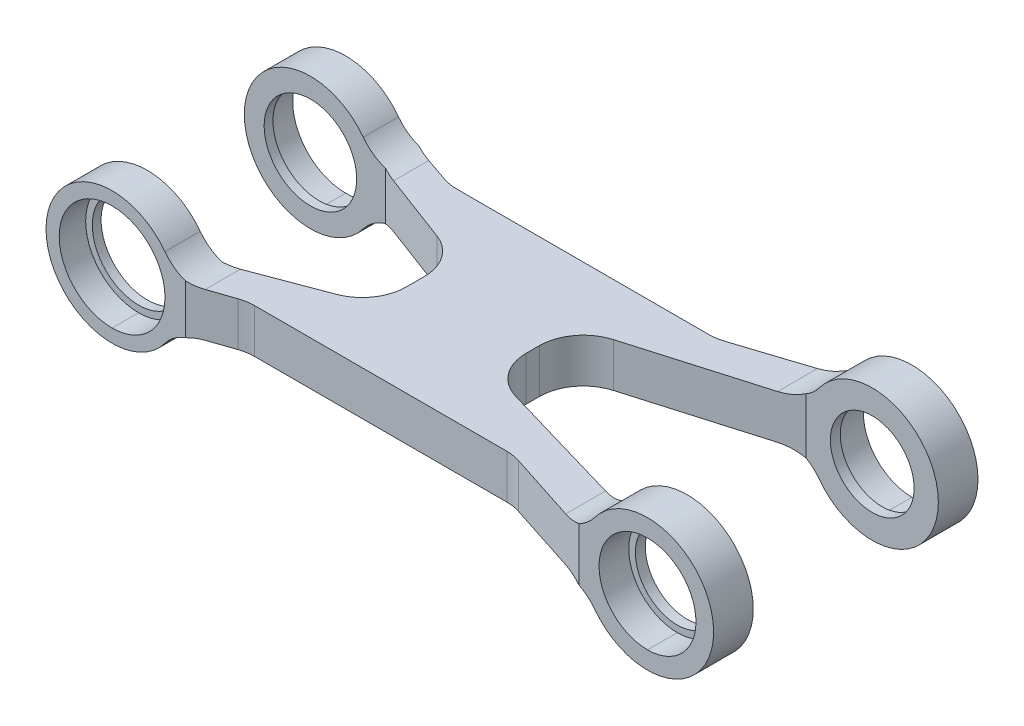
ISO-10303-21;
HEADER;
FILE_DESCRIPTION(('STEP AP214'),'2;1');
FILE_NAME('part.step','',(''),(''),'','','');
FILE_SCHEMA(('AUTOMOTIVE_DESIGN { 1 0 10303 214 1 1 1 1 }'));
ENDSEC;
DATA;
#1=APPLICATION_CONTEXT('core data for automotive mechanical design processes');
#2=APPLICATION_PROTOCOL_DEFINITION('international standard','automotive_design',2000,#1);
#3=PRODUCT_CONTEXT('',#1,'mechanical');
#4=PRODUCT('Part','Part','',(#3));
#5=PRODUCT_RELATED_PRODUCT_CATEGORY('part','',(#4));
#6=PRODUCT_DEFINITION_FORMATION('','',#4);
#7=PRODUCT_DEFINITION_CONTEXT('part definition',#1,'design');
#8=PRODUCT_DEFINITION('design','',#6,#7);
#9=PRODUCT_DEFINITION_SHAPE('','',#8);
#10=(LENGTH_UNIT() NAMED_UNIT(*) SI_UNIT(.MILLI.,.METRE.));
#11=(NAMED_UNIT(*) PLANE_ANGLE_UNIT() SI_UNIT($,.RADIAN.));
#12=(NAMED_UNIT(*) SI_UNIT($,.STERADIAN.) SOLID_ANGLE_UNIT());
#13=UNCERTAINTY_MEASURE_WITH_UNIT(LENGTH_MEASURE(1.E-05),#10,'distance_accuracy_value','');
#14=(GEOMETRIC_REPRESENTATION_CONTEXT(3) GLOBAL_UNCERTAINTY_ASSIGNED_CONTEXT((#13)) GLOBAL_UNIT_ASSIGNED_CONTEXT((#10,
#11,#12)) REPRESENTATION_CONTEXT('',''));
#15=CARTESIAN_POINT('',(0.,0.,0.));
#16=DIRECTION('',(0.,0.,1.));
#17=DIRECTION('',(1.,0.,0.));
#18=AXIS2_PLACEMENT_3D('',#15,#16,#17);
#19=CARTESIAN_POINT('',(0.,0.,60.));
#20=DIRECTION('',(0.,0.,1.));
#21=DIRECTION('',(1.,0.,0.));
#22=AXIS2_PLACEMENT_3D('',#19,#20,#21);
#23=PLANE('',#22);
#24=CARTESIAN_POINT('',(125.,0.,60.));
#25=DIRECTION('',(0.,0.,-1.));
#26=DIRECTION('',(-1.,0.,0.));
#27=AXIS2_PLACEMENT_3D('',#24,#25,#26);
#28=CIRCLE('',#27,11.);
#29=CARTESIAN_POINT('',(125.,11.,60.));
#30=VERTEX_POINT('',#29);
#31=CARTESIAN_POINT('',(125.,-11.,60.));
#32=VERTEX_POINT('',#31);
#33=EDGE_CURVE('E642',#30,#32,#28,.T.);
#34=ORIENTED_EDGE('',*,*,#33,.T.);
#35=EDGE_CURVE('E632',#32,#30,#28,.T.);
#36=ORIENTED_EDGE('',*,*,#35,.T.);
#37=EDGE_LOOP('',(#34,#36));
#38=FACE_BOUND('',#37,.T.);
#39=DIRECTION('',(0.,1.,0.));
#40=VECTOR('',#39,1.);
#41=CARTESIAN_POINT('',(109.440936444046,-15.0000000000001,60.));
#42=LINE('',#41,#40);
#43=CARTESIAN_POINT('',(109.440936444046,-6.04019623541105,60.));
#44=VERTEX_POINT('',#43);
#45=CARTESIAN_POINT('',(109.440936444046,6.04019623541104,60.));
#46=VERTEX_POINT('',#45);
#47=EDGE_CURVE('E392',#44,#46,#42,.T.);
#48=ORIENTED_EDGE('',*,*,#47,.F.);
#49=CARTESIAN_POINT('',(105.,-15.,60.));
#50=DIRECTION('',(0.,0.,1.));
#51=DIRECTION('',(1.,0.,0.));
#52=AXIS2_PLACEMENT_3D('',#49,#50,#51);
#53=CIRCLE('',#52,10.);
#54=CARTESIAN_POINT('',(113.,-9.00000000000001,60.));
#55=VERTEX_POINT('',#54);
#56=EDGE_CURVE('E563',#44,#55,#53,.F.);
#57=ORIENTED_EDGE('',*,*,#56,.T.);
#58=CARTESIAN_POINT('',(125.,0.,60.));
#59=DIRECTION('',(0.,0.,1.));
#60=DIRECTION('',(1.,0.,0.));
#61=AXIS2_PLACEMENT_3D('',#58,#59,#60);
#62=CIRCLE('',#61,15.);
#63=CARTESIAN_POINT('',(113.,9.00000000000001,60.));
#64=VERTEX_POINT('',#63);
#65=EDGE_CURVE('E379',#55,#64,#62,.T.);
#66=ORIENTED_EDGE('',*,*,#65,.T.);
#67=CARTESIAN_POINT('',(105.,15.,60.));
#68=DIRECTION('',(0.,0.,1.));
#69=DIRECTION('',(1.,0.,0.));
#70=AXIS2_PLACEMENT_3D('',#67,#68,#69);
#71=CIRCLE('',#70,10.);
#72=EDGE_CURVE('E590',#64,#46,#71,.F.);
#73=ORIENTED_EDGE('',*,*,#72,.T.);
#74=EDGE_LOOP('',(#48,#57,#66,#73));
#75=FACE_BOUND('',#74,.T.);
#76=ADVANCED_FACE('F40',(#38,#75),#23,.T.);
#77=CARTESIAN_POINT('',(0.,0.,0.));
#78=DIRECTION('',(0.,0.,1.));
#79=DIRECTION('',(1.,0.,0.));
#80=AXIS2_PLACEMENT_3D('',#77,#78,#79);
#81=PLANE('',#80);
#82=CARTESIAN_POINT('',(125.,0.,0.));
#83=DIRECTION('',(0.,0.,-1.));
#84=DIRECTION('',(-1.,0.,0.));
#85=AXIS2_PLACEMENT_3D('',#82,#83,#84);
#86=CIRCLE('',#85,11.);
#87=CARTESIAN_POINT('',(125.,-11.,0.));
#88=VERTEX_POINT('',#87);
#89=CARTESIAN_POINT('',(125.,11.,0.));
#90=VERTEX_POINT('',#89);
#91=EDGE_CURVE('E369',#88,#90,#86,.T.);
#92=ORIENTED_EDGE('',*,*,#91,.F.);
#93=EDGE_CURVE('E656',#90,#88,#86,.T.);
#94=ORIENTED_EDGE('',*,*,#93,.F.);
#95=EDGE_LOOP('',(#92,#94));
#96=FACE_BOUND('',#95,.T.);
#97=CARTESIAN_POINT('',(125.,0.,0.));
#98=DIRECTION('',(0.,0.,1.));
#99=DIRECTION('',(1.,0.,0.));
#100=AXIS2_PLACEMENT_3D('',#97,#98,#99);
#101=CIRCLE('',#100,15.);
#102=CARTESIAN_POINT('',(113.,-9.00000000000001,0.));
#103=VERTEX_POINT('',#102);
#104=CARTESIAN_POINT('',(113.,9.00000000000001,0.));
#105=VERTEX_POINT('',#104);
#106=EDGE_CURVE('E378',#103,#105,#101,.T.);
#107=ORIENTED_EDGE('',*,*,#106,.F.);
#108=CARTESIAN_POINT('',(105.,-15.,0.));
#109=DIRECTION('',(0.,0.,1.));
#110=DIRECTION('',(1.,0.,0.));
#111=AXIS2_PLACEMENT_3D('',#108,#109,#110);
#112=CIRCLE('',#111,10.);
#113=CARTESIAN_POINT('',(109.440936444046,-6.04019623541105,0.));
#114=VERTEX_POINT('',#113);
#115=EDGE_CURVE('E565',#103,#114,#112,.T.);
#116=ORIENTED_EDGE('',*,*,#115,.T.);
#117=DIRECTION('',(0.,1.,0.));
#118=VECTOR('',#117,1.);
#119=CARTESIAN_POINT('',(109.440936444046,-15.,0.));
#120=LINE('',#119,#118);
#121=CARTESIAN_POINT('',(109.440936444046,6.04019623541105,0.));
#122=VERTEX_POINT('',#121);
#123=EDGE_CURVE('E372',#114,#122,#120,.T.);
#124=ORIENTED_EDGE('',*,*,#123,.T.);
#125=CARTESIAN_POINT('',(105.,15.,0.));
#126=DIRECTION('',(0.,0.,1.));
#127=DIRECTION('',(1.,0.,0.));
#128=AXIS2_PLACEMENT_3D('',#125,#126,#127);
#129=CIRCLE('',#128,10.);
#130=EDGE_CURVE('E598',#122,#105,#129,.T.);
#131=ORIENTED_EDGE('',*,*,#130,.T.);
#132=EDGE_LOOP('',(#107,#116,#124,#131));
#133=FACE_BOUND('',#132,.T.);
#134=ADVANCED_FACE('F671',(#96,#133),#81,.F.);
#135=CARTESIAN_POINT('',(-23.2082523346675,-15.0000000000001,3.5));
#136=DIRECTION('',(0.,0.,1.));
#137=DIRECTION('',(1.,0.,0.));
#138=AXIS2_PLACEMENT_3D('',#135,#136,#137);
#139=PLANE('',#138);
#140=CARTESIAN_POINT('',(0.,0.,3.5));
#141=DIRECTION('',(0.,0.,-1.));
#142=DIRECTION('',(-1.,0.,0.));
#143=AXIS2_PLACEMENT_3D('',#140,#141,#142);
#144=CIRCLE('',#143,12.);
#145=CARTESIAN_POINT('',(0.,-12.,3.5));
#146=VERTEX_POINT('',#145);
#147=CARTESIAN_POINT('',(0.,12.,3.5));
#148=VERTEX_POINT('',#147);
#149=EDGE_CURVE('E350',#146,#148,#144,.T.);
#150=ORIENTED_EDGE('',*,*,#149,.F.);
#151=EDGE_CURVE('E356',#148,#146,#144,.T.);
#152=ORIENTED_EDGE('',*,*,#151,.F.);
#153=EDGE_LOOP('',(#150,#152));
#154=FACE_BOUND('',#153,.T.);
#155=DIRECTION('',(0.,1.,0.));
#156=VECTOR('',#155,1.);
#157=CARTESIAN_POINT('',(16.6560510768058,-15.0000000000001,3.5));
#158=LINE('',#157,#156);
#159=CARTESIAN_POINT('',(16.6560510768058,-5.57566948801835,3.5));
#160=VERTEX_POINT('',#159);
#161=CARTESIAN_POINT('',(16.6560510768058,5.57566948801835,3.5));
#162=VERTEX_POINT('',#161);
#163=EDGE_CURVE('E62',#160,#162,#158,.T.);
#164=ORIENTED_EDGE('',*,*,#163,.F.);
#165=CARTESIAN_POINT('',(20.,-15.,3.5));
#166=DIRECTION('',(0.,0.,1.));
#167=DIRECTION('',(1.,0.,0.));
#168=AXIS2_PLACEMENT_3D('',#165,#166,#167);
#169=CIRCLE('',#168,10.);
#170=CARTESIAN_POINT('',(12.,-9.,3.5));
#171=VERTEX_POINT('',#170);
#172=EDGE_CURVE('E539',#160,#171,#169,.T.);
#173=ORIENTED_EDGE('',*,*,#172,.T.);
#174=CARTESIAN_POINT('',(0.,0.,3.5));
#175=DIRECTION('',(0.,0.,1.));
#176=DIRECTION('',(1.,0.,0.));
#177=AXIS2_PLACEMENT_3D('',#174,#175,#176);
#178=CIRCLE('',#177,15.);
#179=CARTESIAN_POINT('',(12.,9.,3.5));
#180=VERTEX_POINT('',#179);
#181=EDGE_CURVE('E374',#180,#171,#178,.T.);
#182=ORIENTED_EDGE('',*,*,#181,.F.);
#183=CARTESIAN_POINT('',(20.,15.,3.5));
#184=DIRECTION('',(0.,0.,1.));
#185=DIRECTION('',(1.,0.,0.));
#186=AXIS2_PLACEMENT_3D('',#183,#184,#185);
#187=CIRCLE('',#186,10.);
#188=EDGE_CURVE('E605',#180,#162,#187,.T.);
#189=ORIENTED_EDGE('',*,*,#188,.T.);
#190=EDGE_LOOP('',(#164,#173,#182,#189));
#191=FACE_BOUND('',#190,.T.);
#192=ADVANCED_FACE('F674',(#154,#191),#139,.F.);
#193=CARTESIAN_POINT('',(109.440936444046,-15.,0.));
#194=DIRECTION('',(0.308019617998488,0.,0.95138000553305));
#195=DIRECTION('',(0.95138000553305,0.,-0.308019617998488));
#196=AXIS2_PLACEMENT_3D('',#193,#194,#195);
#197=PLANE('',#196);
#198=DIRECTION('',(0.95138000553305,0.,-0.308019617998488));
#199=VECTOR('',#198,1.);
#200=CARTESIAN_POINT('',(109.440936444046,-5.,0.));
#201=LINE('',#200,#199);
#202=CARTESIAN_POINT('',(89.091720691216,-5.,6.58827978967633));
#203=VERTEX_POINT('',#202);
#204=CARTESIAN_POINT('',(105.,-5.,1.43780144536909));
#205=VERTEX_POINT('',#204);
#206=EDGE_CURVE('E701',#203,#205,#201,.T.);
#207=ORIENTED_EDGE('',*,*,#206,.F.);
#208=DIRECTION('',(0.,1.,0.));
#209=VECTOR('',#208,1.);
#210=CARTESIAN_POINT('',(89.091720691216,5.,6.58827978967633));
#211=LINE('',#210,#209);
#212=CARTESIAN_POINT('',(89.091720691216,5.,6.58827978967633));
#213=VERTEX_POINT('',#212);
#214=EDGE_CURVE('E442',#203,#213,#211,.T.);
#215=ORIENTED_EDGE('',*,*,#214,.T.);
#216=DIRECTION('',(-0.95138000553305,0.,0.308019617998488));
#217=VECTOR('',#216,1.);
#218=CARTESIAN_POINT('',(109.440936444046,5.,0.));
#219=LINE('',#218,#217);
#220=CARTESIAN_POINT('',(105.,5.,1.43780144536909));
#221=VERTEX_POINT('',#220);
#222=EDGE_CURVE('E784',#221,#213,#219,.T.);
#223=ORIENTED_EDGE('',*,*,#222,.F.);
#224=CARTESIAN_POINT('',(105.,15.,1.43780144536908));
#225=DIRECTION('',(0.308019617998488,0.,0.95138000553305));
#226=DIRECTION('',(0.95138000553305,0.,-0.308019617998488));
#227=AXIS2_PLACEMENT_3D('',#224,#225,#226);
#228=ELLIPSE('',#227,10.5110470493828,10.);
#229=EDGE_CURVE('E595',#221,#122,#228,.T.);
#230=ORIENTED_EDGE('',*,*,#229,.T.);
#231=ORIENTED_EDGE('',*,*,#123,.F.);
#232=CARTESIAN_POINT('',(105.,-15.,1.43780144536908));
#233=DIRECTION('',(0.308019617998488,0.,0.95138000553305));
#234=DIRECTION('',(0.95138000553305,0.,-0.308019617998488));
#235=AXIS2_PLACEMENT_3D('',#232,#233,#234);
#236=ELLIPSE('',#235,10.5110470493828,10.);
#237=EDGE_CURVE('E568',#114,#205,#236,.T.);
#238=ORIENTED_EDGE('',*,*,#237,.T.);
#239=EDGE_LOOP('',(#207,#215,#223,#230,#231,#238));
#240=FACE_BOUND('',#239,.T.);
#241=ADVANCED_FACE('F700',(#240),#197,.F.);
#242=CARTESIAN_POINT('',(60.9054278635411,-15.,7.07447973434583));
#243=DIRECTION('',(0.,0.,1.));
#244=DIRECTION('',(1.,0.,0.));
#245=AXIS2_PLACEMENT_3D('',#242,#243,#244);
#246=PLANE('',#245);
#247=DIRECTION('',(1.,0.,0.));
#248=VECTOR('',#247,1.);
#249=CARTESIAN_POINT('',(60.9054278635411,-5.,7.07447973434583));
#250=LINE('',#249,#248);
#251=CARTESIAN_POINT('',(28.7551006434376,-5.,7.07447973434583));
#252=VERTEX_POINT('',#251);
#253=CARTESIAN_POINT('',(86.0115245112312,-5.,7.07447973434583));
#254=VERTEX_POINT('',#253);
#255=EDGE_CURVE('E710',#252,#254,#250,.T.);
#256=ORIENTED_EDGE('',*,*,#255,.F.);
#257=DIRECTION('',(0.,1.,0.));
#258=VECTOR('',#257,1.);
#259=CARTESIAN_POINT('',(28.7551006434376,5.,7.07447973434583));
#260=LINE('',#259,#258);
#261=CARTESIAN_POINT('',(28.7551006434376,5.,7.07447973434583));
#262=VERTEX_POINT('',#261);
#263=EDGE_CURVE('E437',#252,#262,#260,.T.);
#264=ORIENTED_EDGE('',*,*,#263,.T.);
#265=DIRECTION('',(-1.,0.,0.));
#266=VECTOR('',#265,1.);
#267=CARTESIAN_POINT('',(60.9054278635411,5.,7.07447973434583));
#268=LINE('',#267,#266);
#269=CARTESIAN_POINT('',(86.0115245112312,5.,7.07447973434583));
#270=VERTEX_POINT('',#269);
#271=EDGE_CURVE('E787',#270,#262,#268,.T.);
#272=ORIENTED_EDGE('',*,*,#271,.F.);
#273=DIRECTION('',(0.,1.,0.));
#274=VECTOR('',#273,1.);
#275=CARTESIAN_POINT('',(86.0115245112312,-5.,7.07447973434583));
#276=LINE('',#275,#274);
#277=EDGE_CURVE('E435',#270,#254,#276,.F.);
#278=ORIENTED_EDGE('',*,*,#277,.T.);
#279=EDGE_LOOP('',(#256,#264,#272,#278));
#280=FACE_BOUND('',#279,.T.);
#281=ADVANCED_FACE('F841',(#280),#246,.F.);
#282=CARTESIAN_POINT('',(16.6560510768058,-15.0000000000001,3.5));
#283=DIRECTION('',(-0.32410092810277,0.,0.946022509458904));
#284=DIRECTION('',(0.946022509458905,0.,0.32410092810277));
#285=AXIS2_PLACEMENT_3D('',#282,#283,#284);
#286=PLANE('',#285);
#287=DIRECTION('',(-0.946022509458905,0.,-0.32410092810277));
#288=VECTOR('',#287,1.);
#289=CARTESIAN_POINT('',(16.6560510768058,5.,3.5));
#290=LINE('',#289,#288);
#291=CARTESIAN_POINT('',(25.5140913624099,5.,6.53470482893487));
#292=VERTEX_POINT('',#291);
#293=CARTESIAN_POINT('',(20.,5.,4.6456143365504));
#294=VERTEX_POINT('',#293);
#295=EDGE_CURVE('E790',#292,#294,#290,.T.);
#296=ORIENTED_EDGE('',*,*,#295,.F.);
#297=DIRECTION('',(0.,1.,0.));
#298=VECTOR('',#297,1.);
#299=CARTESIAN_POINT('',(25.5140913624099,-5.,6.53470482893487));
#300=LINE('',#299,#298);
#301=CARTESIAN_POINT('',(25.5140913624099,-5.,6.53470482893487));
#302=VERTEX_POINT('',#301);
#303=EDGE_CURVE('E440',#292,#302,#300,.F.);
#304=ORIENTED_EDGE('',*,*,#303,.T.);
#305=DIRECTION('',(0.946022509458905,0.,0.32410092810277));
#306=VECTOR('',#305,1.);
#307=CARTESIAN_POINT('',(16.6560510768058,-5.,3.5));
#308=LINE('',#307,#306);
#309=CARTESIAN_POINT('',(20.,-5.,4.6456143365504));
#310=VERTEX_POINT('',#309);
#311=EDGE_CURVE('E714',#310,#302,#308,.T.);
#312=ORIENTED_EDGE('',*,*,#311,.F.);
#313=CARTESIAN_POINT('',(20.,-15.,4.6456143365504));
#314=DIRECTION('',(-0.32410092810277,0.,0.946022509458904));
#315=DIRECTION('',(-0.946022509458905,0.,-0.32410092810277));
#316=AXIS2_PLACEMENT_3D('',#313,#314,#315);
#317=ELLIPSE('',#316,10.5705730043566,10.);
#318=EDGE_CURVE('E537',#310,#160,#317,.T.);
#319=ORIENTED_EDGE('',*,*,#318,.T.);
#320=ORIENTED_EDGE('',*,*,#163,.T.);
#321=CARTESIAN_POINT('',(20.,15.,4.6456143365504));
#322=DIRECTION('',(-0.32410092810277,0.,0.946022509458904));
#323=DIRECTION('',(-0.946022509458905,0.,-0.32410092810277));
#324=AXIS2_PLACEMENT_3D('',#321,#322,#323);
#325=ELLIPSE('',#324,10.5705730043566,10.);
#326=EDGE_CURVE('E607',#162,#294,#325,.T.);
#327=ORIENTED_EDGE('',*,*,#326,.T.);
#328=EDGE_LOOP('',(#296,#304,#312,#319,#320,#327));
#329=FACE_BOUND('',#328,.T.);
#330=ADVANCED_FACE('F834',(#329),#286,.F.);
#331=CARTESIAN_POINT('',(-23.2082523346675,-15.0000000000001,56.5));
#332=DIRECTION('',(0.,0.,1.));
#333=DIRECTION('',(1.,0.,0.));
#334=AXIS2_PLACEMENT_3D('',#331,#332,#333);
#335=PLANE('',#334);
#336=CARTESIAN_POINT('',(0.,0.,56.5));
#337=DIRECTION('',(0.,0.,-1.));
#338=DIRECTION('',(-1.,0.,0.));
#339=AXIS2_PLACEMENT_3D('',#336,#337,#338);
#340=CIRCLE('',#339,12.);
#341=CARTESIAN_POINT('',(0.,12.,56.5));
#342=VERTEX_POINT('',#341);
#343=CARTESIAN_POINT('',(0.,-12.,56.5));
#344=VERTEX_POINT('',#343);
#345=EDGE_CURVE('E648',#342,#344,#340,.T.);
#346=ORIENTED_EDGE('',*,*,#345,.T.);
#347=EDGE_CURVE('E397',#344,#342,#340,.T.);
#348=ORIENTED_EDGE('',*,*,#347,.T.);
#349=EDGE_LOOP('',(#346,#348));
#350=FACE_BOUND('',#349,.T.);
#351=DIRECTION('',(0.,1.,0.));
#352=VECTOR('',#351,1.);
#353=CARTESIAN_POINT('',(16.6560510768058,-15.0000000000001,56.5));
#354=LINE('',#353,#352);
#355=CARTESIAN_POINT('',(16.6560510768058,-5.57566948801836,56.5));
#356=VERTEX_POINT('',#355);
#357=CARTESIAN_POINT('',(16.6560510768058,5.57566948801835,56.5));
#358=VERTEX_POINT('',#357);
#359=EDGE_CURVE('E651',#356,#358,#354,.T.);
#360=ORIENTED_EDGE('',*,*,#359,.T.);
#361=CARTESIAN_POINT('',(20.,15.,56.5));
#362=DIRECTION('',(0.,0.,1.));
#363=DIRECTION('',(1.,0.,0.));
#364=AXIS2_PLACEMENT_3D('',#361,#362,#363);
#365=CIRCLE('',#364,10.);
#366=CARTESIAN_POINT('',(12.,9.,56.5));
#367=VERTEX_POINT('',#366);
#368=EDGE_CURVE('E583',#358,#367,#365,.F.);
#369=ORIENTED_EDGE('',*,*,#368,.T.);
#370=CARTESIAN_POINT('',(0.,0.,56.5));
#371=DIRECTION('',(0.,0.,1.));
#372=DIRECTION('',(1.,0.,0.));
#373=AXIS2_PLACEMENT_3D('',#370,#371,#372);
#374=CIRCLE('',#373,15.);
#375=CARTESIAN_POINT('',(12.,-9.,56.5));
#376=VERTEX_POINT('',#375);
#377=EDGE_CURVE('E653',#367,#376,#374,.T.);
#378=ORIENTED_EDGE('',*,*,#377,.T.);
#379=CARTESIAN_POINT('',(20.,-15.,56.5));
#380=DIRECTION('',(0.,0.,1.));
#381=DIRECTION('',(1.,0.,0.));
#382=AXIS2_PLACEMENT_3D('',#379,#380,#381);
#383=CIRCLE('',#382,10.);
#384=EDGE_CURVE('E550',#376,#356,#383,.F.);
#385=ORIENTED_EDGE('',*,*,#384,.T.);
#386=EDGE_LOOP('',(#360,#369,#378,#385));
#387=FACE_BOUND('',#386,.T.);
#388=ADVANCED_FACE('F742',(#350,#387),#335,.T.);
#389=CARTESIAN_POINT('',(16.6560510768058,-15.0000000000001,56.5));
#390=DIRECTION('',(0.32410092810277,0.,0.946022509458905));
#391=DIRECTION('',(0.946022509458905,0.,-0.32410092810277));
#392=AXIS2_PLACEMENT_3D('',#389,#390,#391);
#393=PLANE('',#392);
#394=DIRECTION('',(0.946022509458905,0.,-0.32410092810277));
#395=VECTOR('',#394,1.);
#396=CARTESIAN_POINT('',(16.6560510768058,-5.,56.5));
#397=LINE('',#396,#395);
#398=CARTESIAN_POINT('',(20.,-5.,55.3543856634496));
#399=VERTEX_POINT('',#398);
#400=CARTESIAN_POINT('',(25.5140913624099,-5.,53.4652951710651));
#401=VERTEX_POINT('',#400);
#402=EDGE_CURVE('E757',#399,#401,#397,.T.);
#403=ORIENTED_EDGE('',*,*,#402,.T.);
#404=DIRECTION('',(0.,1.,0.));
#405=VECTOR('',#404,1.);
#406=CARTESIAN_POINT('',(25.5140913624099,5.,53.4652951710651));
#407=LINE('',#406,#405);
#408=CARTESIAN_POINT('',(25.5140913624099,5.,53.4652951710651));
#409=VERTEX_POINT('',#408);
#410=EDGE_CURVE('E432',#401,#409,#407,.T.);
#411=ORIENTED_EDGE('',*,*,#410,.T.);
#412=DIRECTION('',(-0.946022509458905,0.,0.32410092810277));
#413=VECTOR('',#412,1.);
#414=CARTESIAN_POINT('',(16.6560510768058,5.,56.5));
#415=LINE('',#414,#413);
#416=CARTESIAN_POINT('',(20.,5.,55.3543856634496));
#417=VERTEX_POINT('',#416);
#418=EDGE_CURVE('E793',#409,#417,#415,.T.);
#419=ORIENTED_EDGE('',*,*,#418,.T.);
#420=CARTESIAN_POINT('',(20.,15.,55.3543856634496));
#421=DIRECTION('',(0.32410092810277,0.,0.946022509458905));
#422=DIRECTION('',(0.946022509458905,0.,-0.32410092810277));
#423=AXIS2_PLACEMENT_3D('',#420,#421,#422);
#424=ELLIPSE('',#423,10.5705730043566,10.);
#425=EDGE_CURVE('E580',#417,#358,#424,.F.);
#426=ORIENTED_EDGE('',*,*,#425,.T.);
#427=ORIENTED_EDGE('',*,*,#359,.F.);
#428=CARTESIAN_POINT('',(20.,-15.,55.3543856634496));
#429=DIRECTION('',(0.32410092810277,0.,0.946022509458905));
#430=DIRECTION('',(0.946022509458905,0.,-0.32410092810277));
#431=AXIS2_PLACEMENT_3D('',#428,#429,#430);
#432=ELLIPSE('',#431,10.5705730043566,10.);
#433=EDGE_CURVE('E553',#356,#399,#432,.F.);
#434=ORIENTED_EDGE('',*,*,#433,.T.);
#435=EDGE_LOOP('',(#403,#411,#419,#426,#427,#434));
#436=FACE_BOUND('',#435,.T.);
#437=ADVANCED_FACE('F891',(#436),#393,.T.);
#438=CARTESIAN_POINT('',(27.089647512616,-15.0000000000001,52.9255202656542));
#439=DIRECTION('',(0.,0.,1.));
#440=DIRECTION('',(1.,0.,0.));
#441=AXIS2_PLACEMENT_3D('',#438,#439,#440);
#442=PLANE('',#441);
#443=DIRECTION('',(1.,0.,0.));
#444=VECTOR('',#443,1.);
#445=CARTESIAN_POINT('',(27.089647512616,-5.,52.9255202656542));
#446=LINE('',#445,#444);
#447=CARTESIAN_POINT('',(28.7551006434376,-5.,52.9255202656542));
#448=VERTEX_POINT('',#447);
#449=CARTESIAN_POINT('',(86.0115245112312,-5.,52.9255202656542));
#450=VERTEX_POINT('',#449);
#451=EDGE_CURVE('E762',#448,#450,#446,.T.);
#452=ORIENTED_EDGE('',*,*,#451,.T.);
#453=DIRECTION('',(0.,1.,0.));
#454=VECTOR('',#453,1.);
#455=CARTESIAN_POINT('',(86.0115245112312,5.,52.9255202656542));
#456=LINE('',#455,#454);
#457=CARTESIAN_POINT('',(86.0115245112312,5.,52.9255202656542));
#458=VERTEX_POINT('',#457);
#459=EDGE_CURVE('E427',#450,#458,#456,.T.);
#460=ORIENTED_EDGE('',*,*,#459,.T.);
#461=DIRECTION('',(-1.,0.,0.));
#462=VECTOR('',#461,1.);
#463=CARTESIAN_POINT('',(27.089647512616,5.,52.9255202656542));
#464=LINE('',#463,#462);
#465=CARTESIAN_POINT('',(28.7551006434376,5.,52.9255202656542));
#466=VERTEX_POINT('',#465);
#467=EDGE_CURVE('E796',#458,#466,#464,.T.);
#468=ORIENTED_EDGE('',*,*,#467,.T.);
#469=DIRECTION('',(0.,1.,0.));
#470=VECTOR('',#469,1.);
#471=CARTESIAN_POINT('',(28.7551006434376,-5.,52.9255202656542));
#472=LINE('',#471,#470);
#473=EDGE_CURVE('E425',#466,#448,#472,.F.);
#474=ORIENTED_EDGE('',*,*,#473,.T.);
#475=EDGE_LOOP('',(#452,#460,#468,#474));
#476=FACE_BOUND('',#475,.T.);
#477=ADVANCED_FACE('F885',(#476),#442,.T.);
#478=CARTESIAN_POINT('',(109.440936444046,-15.0000000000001,60.));
#479=DIRECTION('',(-0.308019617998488,0.,0.95138000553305));
#480=DIRECTION('',(0.95138000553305,0.,0.308019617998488));
#481=AXIS2_PLACEMENT_3D('',#478,#479,#480);
#482=PLANE('',#481);
#483=DIRECTION('',(-0.95138000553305,0.,-0.308019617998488));
#484=VECTOR('',#483,1.);
#485=CARTESIAN_POINT('',(109.440936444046,5.,60.));
#486=LINE('',#485,#484);
#487=CARTESIAN_POINT('',(105.,5.,58.5621985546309));
#488=VERTEX_POINT('',#487);
#489=CARTESIAN_POINT('',(89.091720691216,5.,53.4117202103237));
#490=VERTEX_POINT('',#489);
#491=EDGE_CURVE('E799',#488,#490,#486,.T.);
#492=ORIENTED_EDGE('',*,*,#491,.T.);
#493=DIRECTION('',(0.,1.,0.));
#494=VECTOR('',#493,1.);
#495=CARTESIAN_POINT('',(89.091720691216,-5.,53.4117202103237));
#496=LINE('',#495,#494);
#497=CARTESIAN_POINT('',(89.091720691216,-5.,53.4117202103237));
#498=VERTEX_POINT('',#497);
#499=EDGE_CURVE('E430',#490,#498,#496,.F.);
#500=ORIENTED_EDGE('',*,*,#499,.T.);
#501=DIRECTION('',(0.95138000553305,0.,0.308019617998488));
#502=VECTOR('',#501,1.);
#503=CARTESIAN_POINT('',(109.440936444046,-5.,60.));
#504=LINE('',#503,#502);
#505=CARTESIAN_POINT('',(105.,-5.,58.5621985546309));
#506=VERTEX_POINT('',#505);
#507=EDGE_CURVE('E766',#498,#506,#504,.T.);
#508=ORIENTED_EDGE('',*,*,#507,.T.);
#509=CARTESIAN_POINT('',(105.,-15.,58.5621985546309));
#510=DIRECTION('',(-0.308019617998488,0.,0.95138000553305));
#511=DIRECTION('',(-0.95138000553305,0.,-0.308019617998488));
#512=AXIS2_PLACEMENT_3D('',#509,#510,#511);
#513=ELLIPSE('',#512,10.5110470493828,10.);
#514=EDGE_CURVE('E560',#506,#44,#513,.F.);
#515=ORIENTED_EDGE('',*,*,#514,.T.);
#516=ORIENTED_EDGE('',*,*,#47,.T.);
#517=CARTESIAN_POINT('',(105.,15.,58.5621985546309));
#518=DIRECTION('',(-0.308019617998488,0.,0.95138000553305));
#519=DIRECTION('',(-0.95138000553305,0.,-0.308019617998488));
#520=AXIS2_PLACEMENT_3D('',#517,#518,#519);
#521=ELLIPSE('',#520,10.5110470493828,10.);
#522=EDGE_CURVE('E593',#46,#488,#521,.F.);
#523=ORIENTED_EDGE('',*,*,#522,.T.);
#524=EDGE_LOOP('',(#492,#500,#508,#515,#516,#523));
#525=FACE_BOUND('',#524,.T.);
#526=ADVANCED_FACE('F878',(#525),#482,.T.);
#527=CARTESIAN_POINT('',(145.922919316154,-15.0000000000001,51.));
#528=DIRECTION('',(0.,0.,1.));
#529=DIRECTION('',(1.,0.,0.));
#530=AXIS2_PLACEMENT_3D('',#527,#528,#529);
#531=PLANE('',#530);
#532=CARTESIAN_POINT('',(125.,0.,51.));
#533=DIRECTION('',(0.,0.,1.));
#534=DIRECTION('',(1.,0.,0.));
#535=AXIS2_PLACEMENT_3D('',#532,#533,#534);
#536=CIRCLE('',#535,9.50000000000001);
#537=CARTESIAN_POINT('',(134.5,0.,51.));
#538=VERTEX_POINT('',#537);
#539=EDGE_CURVE('E725',#538,#538,#536,.T.);
#540=ORIENTED_EDGE('',*,*,#539,.T.);
#541=EDGE_LOOP('',(#540));
#542=FACE_BOUND('',#541,.T.);
#543=CARTESIAN_POINT('',(125.,0.,51.));
#544=DIRECTION('',(0.,0.,1.));
#545=DIRECTION('',(1.,0.,0.));
#546=AXIS2_PLACEMENT_3D('',#543,#544,#545);
#547=CIRCLE('',#546,15.);
#548=CARTESIAN_POINT('',(113.,-9.00000000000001,51.));
#549=VERTEX_POINT('',#548);
#550=CARTESIAN_POINT('',(113.,9.00000000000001,51.));
#551=VERTEX_POINT('',#550);
#552=EDGE_CURVE('E361',#549,#551,#547,.T.);
#553=ORIENTED_EDGE('',*,*,#552,.F.);
#554=CARTESIAN_POINT('',(105.,-15.,51.));
#555=DIRECTION('',(0.,0.,1.));
#556=DIRECTION('',(1.,0.,0.));
#557=AXIS2_PLACEMENT_3D('',#554,#555,#556);
#558=CIRCLE('',#557,10.);
#559=CARTESIAN_POINT('',(110.,-6.33974596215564,51.));
#560=VERTEX_POINT('',#559);
#561=EDGE_CURVE('E555',#549,#560,#558,.T.);
#562=ORIENTED_EDGE('',*,*,#561,.T.);
#563=DIRECTION('',(0.,1.,0.));
#564=VECTOR('',#563,1.);
#565=CARTESIAN_POINT('',(110.,-15.0000000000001,51.));
#566=LINE('',#565,#564);
#567=CARTESIAN_POINT('',(110.,6.33974596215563,51.));
#568=VERTEX_POINT('',#567);
#569=EDGE_CURVE('E712',#560,#568,#566,.T.);
#570=ORIENTED_EDGE('',*,*,#569,.T.);
#571=CARTESIAN_POINT('',(105.,15.,51.));
#572=DIRECTION('',(0.,0.,1.));
#573=DIRECTION('',(1.,0.,0.));
#574=AXIS2_PLACEMENT_3D('',#571,#572,#573);
#575=CIRCLE('',#574,10.);
#576=EDGE_CURVE('E588',#568,#551,#575,.T.);
#577=ORIENTED_EDGE('',*,*,#576,.T.);
#578=EDGE_LOOP('',(#553,#562,#570,#577));
#579=FACE_BOUND('',#578,.T.);
#580=ADVANCED_FACE('F1028',(#542,#579),#531,.F.);
#581=CARTESIAN_POINT('',(145.922919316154,-15.0000000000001,8.99999999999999));
#582=DIRECTION('',(0.,0.,-1.));
#583=DIRECTION('',(-1.,0.,0.));
#584=AXIS2_PLACEMENT_3D('',#581,#582,#583);
#585=PLANE('',#584);
#586=CARTESIAN_POINT('',(125.,0.,8.99999999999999));
#587=DIRECTION('',(0.,0.,-1.));
#588=DIRECTION('',(-1.,0.,0.));
#589=AXIS2_PLACEMENT_3D('',#586,#587,#588);
#590=CIRCLE('',#589,9.50000000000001);
#591=CARTESIAN_POINT('',(115.5,0.,9.));
#592=VERTEX_POINT('',#591);
#593=EDGE_CURVE('E719',#592,#592,#590,.T.);
#594=ORIENTED_EDGE('',*,*,#593,.T.);
#595=EDGE_LOOP('',(#594));
#596=FACE_BOUND('',#595,.T.);
#597=DIRECTION('',(0.,1.,0.));
#598=VECTOR('',#597,1.);
#599=CARTESIAN_POINT('',(110.,-15.0000000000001,9.));
#600=LINE('',#599,#598);
#601=CARTESIAN_POINT('',(110.,-6.33974596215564,9.));
#602=VERTEX_POINT('',#601);
#603=CARTESIAN_POINT('',(110.,6.33974596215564,9.));
#604=VERTEX_POINT('',#603);
#605=EDGE_CURVE('E691',#602,#604,#600,.T.);
#606=ORIENTED_EDGE('',*,*,#605,.F.);
#607=CARTESIAN_POINT('',(105.,-15.,9.));
#608=DIRECTION('',(0.,0.,-1.));
#609=DIRECTION('',(-1.,0.,0.));
#610=AXIS2_PLACEMENT_3D('',#607,#608,#609);
#611=CIRCLE('',#610,10.);
#612=CARTESIAN_POINT('',(113.,-9.00000000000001,9.));
#613=VERTEX_POINT('',#612);
#614=EDGE_CURVE('E573',#602,#613,#611,.T.);
#615=ORIENTED_EDGE('',*,*,#614,.T.);
#616=CARTESIAN_POINT('',(125.,0.,8.99999999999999));
#617=DIRECTION('',(0.,0.,-1.));
#618=DIRECTION('',(-1.,0.,0.));
#619=AXIS2_PLACEMENT_3D('',#616,#617,#618);
#620=CIRCLE('',#619,15.);
#621=CARTESIAN_POINT('',(113.,9.00000000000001,9.));
#622=VERTEX_POINT('',#621);
#623=EDGE_CURVE('E382',#622,#613,#620,.T.);
#624=ORIENTED_EDGE('',*,*,#623,.F.);
#625=CARTESIAN_POINT('',(105.,15.,9.));
#626=DIRECTION('',(0.,0.,-1.));
#627=DIRECTION('',(-1.,0.,0.));
#628=AXIS2_PLACEMENT_3D('',#625,#626,#627);
#629=CIRCLE('',#628,10.);
#630=EDGE_CURVE('E600',#622,#604,#629,.T.);
#631=ORIENTED_EDGE('',*,*,#630,.T.);
#632=EDGE_LOOP('',(#606,#615,#624,#631));
#633=FACE_BOUND('',#632,.T.);
#634=ADVANCED_FACE('F690',(#596,#633),#585,.F.);
#635=CARTESIAN_POINT('',(68.9458360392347,-15.0000000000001,39.));
#636=DIRECTION('',(-0.280557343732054,0.,0.959837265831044));
#637=DIRECTION('',(0.959837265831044,0.,0.280557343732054));
#638=AXIS2_PLACEMENT_3D('',#635,#636,#637);
#639=PLANE('',#638);
#640=DIRECTION('',(0.959837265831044,0.,0.280557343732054));
#641=VECTOR('',#640,1.);
#642=CARTESIAN_POINT('',(68.9458360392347,-5.,39.));
#643=LINE('',#642,#641);
#644=CARTESIAN_POINT('',(76.1402626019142,-5.,41.1029077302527));
#645=VERTEX_POINT('',#644);
#646=CARTESIAN_POINT('',(105.,-5.,49.5385160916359));
#647=VERTEX_POINT('',#646);
#648=EDGE_CURVE('E771',#645,#647,#643,.T.);
#649=ORIENTED_EDGE('',*,*,#648,.F.);
#650=DIRECTION('',(0.,1.,0.));
#651=VECTOR('',#650,1.);
#652=CARTESIAN_POINT('',(76.1402626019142,5.00000000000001,41.1029077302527));
#653=LINE('',#652,#651);
#654=CARTESIAN_POINT('',(76.1402626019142,5.,41.1029077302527));
#655=VERTEX_POINT('',#654);
#656=EDGE_CURVE('E462',#645,#655,#653,.T.);
#657=ORIENTED_EDGE('',*,*,#656,.T.);
#658=DIRECTION('',(-0.959837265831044,0.,-0.280557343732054));
#659=VECTOR('',#658,1.);
#660=CARTESIAN_POINT('',(68.9458360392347,5.,39.));
#661=LINE('',#660,#659);
#662=CARTESIAN_POINT('',(105.,5.,49.5385160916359));
#663=VERTEX_POINT('',#662);
#664=EDGE_CURVE('E802',#663,#655,#661,.T.);
#665=ORIENTED_EDGE('',*,*,#664,.F.);
#666=CARTESIAN_POINT('',(105.,15.,49.5385160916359));
#667=DIRECTION('',(-0.280557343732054,0.,0.959837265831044));
#668=DIRECTION('',(-0.959837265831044,0.,-0.280557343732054));
#669=AXIS2_PLACEMENT_3D('',#666,#667,#668);
#670=ELLIPSE('',#669,10.418432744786,10.);
#671=EDGE_CURVE('E585',#663,#568,#670,.T.);
#672=ORIENTED_EDGE('',*,*,#671,.T.);
#673=ORIENTED_EDGE('',*,*,#569,.F.);
#674=CARTESIAN_POINT('',(105.,-15.,49.5385160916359));
#675=DIRECTION('',(-0.280557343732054,0.,0.959837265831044));
#676=DIRECTION('',(-0.959837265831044,0.,-0.280557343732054));
#677=AXIS2_PLACEMENT_3D('',#674,#675,#676);
#678=ELLIPSE('',#677,10.418432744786,10.);
#679=EDGE_CURVE('E558',#560,#647,#678,.T.);
#680=ORIENTED_EDGE('',*,*,#679,.T.);
#681=EDGE_LOOP('',(#649,#657,#665,#672,#673,#680));
#682=FACE_BOUND('',#681,.T.);
#683=ADVANCED_FACE('F867',(#682),#639,.F.);
#684=CARTESIAN_POINT('',(68.9458360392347,-15.0000000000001,21.));
#685=DIRECTION('',(-1.,0.,0.));
#686=DIRECTION('',(0.,-1.,0.));
#687=AXIS2_PLACEMENT_3D('',#684,#685,#686);
#688=PLANE('',#687);
#689=DIRECTION('',(0.,0.,1.));
#690=VECTOR('',#689,1.);
#691=CARTESIAN_POINT('',(68.9458360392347,-5.,21.));
#692=LINE('',#691,#690);
#693=CARTESIAN_POINT('',(68.9458360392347,-5.,28.4954649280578));
#694=VERTEX_POINT('',#693);
#695=CARTESIAN_POINT('',(68.9458360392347,-5.,31.5045350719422));
#696=VERTEX_POINT('',#695);
#697=EDGE_CURVE('E774',#694,#696,#692,.T.);
#698=ORIENTED_EDGE('',*,*,#697,.F.);
#699=DIRECTION('',(0.,1.,0.));
#700=VECTOR('',#699,1.);
#701=CARTESIAN_POINT('',(68.9458360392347,5.,28.4954649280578));
#702=LINE('',#701,#700);
#703=CARTESIAN_POINT('',(68.9458360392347,5.,28.4954649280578));
#704=VERTEX_POINT('',#703);
#705=EDGE_CURVE('E457',#694,#704,#702,.T.);
#706=ORIENTED_EDGE('',*,*,#705,.T.);
#707=DIRECTION('',(0.,0.,-1.));
#708=VECTOR('',#707,1.);
#709=CARTESIAN_POINT('',(68.9458360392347,5.,21.));
#710=LINE('',#709,#708);
#711=CARTESIAN_POINT('',(68.9458360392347,5.,31.5045350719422));
#712=VERTEX_POINT('',#711);
#713=EDGE_CURVE('E805',#712,#704,#710,.T.);
#714=ORIENTED_EDGE('',*,*,#713,.F.);
#715=DIRECTION('',(0.,1.,0.));
#716=VECTOR('',#715,1.);
#717=CARTESIAN_POINT('',(68.9458360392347,-5.,31.5045350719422));
#718=LINE('',#717,#716);
#719=EDGE_CURVE('E455',#712,#696,#718,.F.);
#720=ORIENTED_EDGE('',*,*,#719,.T.);
#721=EDGE_LOOP('',(#698,#706,#714,#720));
#722=FACE_BOUND('',#721,.T.);
#723=ADVANCED_FACE('F858',(#722),#688,.F.);
#724=CARTESIAN_POINT('',(110.,-15.0000000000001,9.));
#725=DIRECTION('',(-0.280557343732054,0.,-0.959837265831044));
#726=DIRECTION('',(-0.959837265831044,0.,0.280557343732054));
#727=AXIS2_PLACEMENT_3D('',#724,#725,#726);
#728=PLANE('',#727);
#729=DIRECTION('',(0.959837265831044,0.,-0.280557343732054));
#730=VECTOR('',#729,1.);
#731=CARTESIAN_POINT('',(110.,5.,9.));
#732=LINE('',#731,#730);
#733=CARTESIAN_POINT('',(76.1402626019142,5.,18.8970922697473));
#734=VERTEX_POINT('',#733);
#735=CARTESIAN_POINT('',(105.,5.,10.4614839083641));
#736=VERTEX_POINT('',#735);
#737=EDGE_CURVE('E808',#734,#736,#732,.T.);
#738=ORIENTED_EDGE('',*,*,#737,.F.);
#739=DIRECTION('',(0.,1.,0.));
#740=VECTOR('',#739,1.);
#741=CARTESIAN_POINT('',(76.1402626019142,-5.,18.8970922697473));
#742=LINE('',#741,#740);
#743=CARTESIAN_POINT('',(76.1402626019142,-5.,18.8970922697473));
#744=VERTEX_POINT('',#743);
#745=EDGE_CURVE('E460',#734,#744,#742,.F.);
#746=ORIENTED_EDGE('',*,*,#745,.T.);
#747=DIRECTION('',(-0.959837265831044,0.,0.280557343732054));
#748=VECTOR('',#747,1.);
#749=CARTESIAN_POINT('',(110.,-5.,9.));
#750=LINE('',#749,#748);
#751=CARTESIAN_POINT('',(105.,-5.,10.4614839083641));
#752=VERTEX_POINT('',#751);
#753=EDGE_CURVE('E777',#752,#744,#750,.T.);
#754=ORIENTED_EDGE('',*,*,#753,.F.);
#755=CARTESIAN_POINT('',(105.,-15.,10.4614839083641));
#756=DIRECTION('',(-0.280557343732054,0.,-0.959837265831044));
#757=DIRECTION('',(0.959837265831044,0.,-0.280557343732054));
#758=AXIS2_PLACEMENT_3D('',#755,#756,#757);
#759=ELLIPSE('',#758,10.418432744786,10.);
#760=EDGE_CURVE('E570',#752,#602,#759,.T.);
#761=ORIENTED_EDGE('',*,*,#760,.T.);
#762=ORIENTED_EDGE('',*,*,#605,.T.);
#763=CARTESIAN_POINT('',(105.,15.,10.4614839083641));
#764=DIRECTION('',(-0.280557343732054,0.,-0.959837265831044));
#765=DIRECTION('',(0.959837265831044,0.,-0.280557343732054));
#766=AXIS2_PLACEMENT_3D('',#763,#764,#765);
#767=ELLIPSE('',#766,10.418432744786,10.);
#768=EDGE_CURVE('E603',#604,#736,#767,.T.);
#769=ORIENTED_EDGE('',*,*,#768,.T.);
#770=EDGE_LOOP('',(#738,#746,#754,#761,#762,#769));
#771=FACE_BOUND('',#770,.T.);
#772=ADVANCED_FACE('F850',(#771),#728,.F.);
#773=CARTESIAN_POINT('',(-21.1981217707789,-15.0000000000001,11.5));
#774=DIRECTION('',(0.,0.,-1.));
#775=DIRECTION('',(-1.,0.,0.));
#776=AXIS2_PLACEMENT_3D('',#773,#774,#775);
#777=PLANE('',#776);
#778=CARTESIAN_POINT('',(0.,0.,11.5));
#779=DIRECTION('',(0.,0.,-1.));
#780=DIRECTION('',(-1.,0.,0.));
#781=AXIS2_PLACEMENT_3D('',#778,#779,#780);
#782=CIRCLE('',#781,10.5);
#783=CARTESIAN_POINT('',(-10.5,0.,11.5));
#784=VERTEX_POINT('',#783);
#785=EDGE_CURVE('E628',#784,#784,#782,.T.);
#786=ORIENTED_EDGE('',*,*,#785,.T.);
#787=EDGE_LOOP('',(#786));
#788=FACE_BOUND('',#787,.T.);
#789=CARTESIAN_POINT('',(0.,0.,11.5));
#790=DIRECTION('',(0.,0.,-1.));
#791=DIRECTION('',(-1.,0.,0.));
#792=AXIS2_PLACEMENT_3D('',#789,#790,#791);
#793=CIRCLE('',#792,15.);
#794=CARTESIAN_POINT('',(12.,-9.,11.5));
#795=VERTEX_POINT('',#794);
#796=CARTESIAN_POINT('',(12.,9.,11.5));
#797=VERTEX_POINT('',#796);
#798=EDGE_CURVE('E622',#795,#797,#793,.T.);
#799=ORIENTED_EDGE('',*,*,#798,.F.);
#800=CARTESIAN_POINT('',(20.,-15.,11.5));
#801=DIRECTION('',(0.,0.,-1.));
#802=DIRECTION('',(-1.,0.,0.));
#803=AXIS2_PLACEMENT_3D('',#800,#801,#802);
#804=CIRCLE('',#803,10.);
#805=CARTESIAN_POINT('',(17.,-5.46060798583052,11.5));
#806=VERTEX_POINT('',#805);
#807=EDGE_CURVE('E541',#795,#806,#804,.T.);
#808=ORIENTED_EDGE('',*,*,#807,.T.);
#809=DIRECTION('',(0.,1.,0.));
#810=VECTOR('',#809,1.);
#811=CARTESIAN_POINT('',(17.,-15.0000000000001,11.5));
#812=LINE('',#811,#810);
#813=CARTESIAN_POINT('',(17.,5.46060798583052,11.5));
#814=VERTEX_POINT('',#813);
#815=EDGE_CURVE('E54',#806,#814,#812,.T.);
#816=ORIENTED_EDGE('',*,*,#815,.T.);
#817=CARTESIAN_POINT('',(20.,15.,11.5));
#818=DIRECTION('',(0.,0.,-1.));
#819=DIRECTION('',(-1.,0.,0.));
#820=AXIS2_PLACEMENT_3D('',#817,#818,#819);
#821=CIRCLE('',#820,10.);
#822=EDGE_CURVE('E12',#814,#797,#821,.T.);
#823=ORIENTED_EDGE('',*,*,#822,.T.);
#824=EDGE_LOOP('',(#799,#808,#816,#823));
#825=FACE_BOUND('',#824,.T.);
#826=ADVANCED_FACE('F621',(#788,#825),#777,.F.);
#827=CARTESIAN_POINT('',(-21.1981217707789,-15.0000000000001,48.5));
#828=DIRECTION('',(0.,0.,1.));
#829=DIRECTION('',(1.,0.,0.));
#830=AXIS2_PLACEMENT_3D('',#827,#828,#829);
#831=PLANE('',#830);
#832=CARTESIAN_POINT('',(0.,0.,48.5));
#833=DIRECTION('',(0.,0.,1.));
#834=DIRECTION('',(1.,0.,0.));
#835=AXIS2_PLACEMENT_3D('',#832,#833,#834);
#836=CIRCLE('',#835,10.5);
#837=CARTESIAN_POINT('',(10.5,0.,48.5));
#838=VERTEX_POINT('',#837);
#839=EDGE_CURVE('E629',#838,#838,#836,.T.);
#840=ORIENTED_EDGE('',*,*,#839,.T.);
#841=EDGE_LOOP('',(#840));
#842=FACE_BOUND('',#841,.T.);
#843=DIRECTION('',(0.,1.,0.));
#844=VECTOR('',#843,1.);
#845=CARTESIAN_POINT('',(17.,-15.0000000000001,48.5));
#846=LINE('',#845,#844);
#847=CARTESIAN_POINT('',(17.,-5.46060798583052,48.5));
#848=VERTEX_POINT('',#847);
#849=CARTESIAN_POINT('',(17.,5.46060798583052,48.5));
#850=VERTEX_POINT('',#849);
#851=EDGE_CURVE('E720',#848,#850,#846,.T.);
#852=ORIENTED_EDGE('',*,*,#851,.F.);
#853=CARTESIAN_POINT('',(20.,-15.,48.5));
#854=DIRECTION('',(0.,0.,1.));
#855=DIRECTION('',(1.,0.,0.));
#856=AXIS2_PLACEMENT_3D('',#853,#854,#855);
#857=CIRCLE('',#856,10.);
#858=CARTESIAN_POINT('',(12.,-9.,48.5));
#859=VERTEX_POINT('',#858);
#860=EDGE_CURVE('E548',#848,#859,#857,.T.);
#861=ORIENTED_EDGE('',*,*,#860,.T.);
#862=CARTESIAN_POINT('',(0.,0.,48.5));
#863=DIRECTION('',(0.,0.,1.));
#864=DIRECTION('',(1.,0.,0.));
#865=AXIS2_PLACEMENT_3D('',#862,#863,#864);
#866=CIRCLE('',#865,15.);
#867=CARTESIAN_POINT('',(12.,9.,48.5));
#868=VERTEX_POINT('',#867);
#869=EDGE_CURVE('E635',#868,#859,#866,.T.);
#870=ORIENTED_EDGE('',*,*,#869,.F.);
#871=CARTESIAN_POINT('',(20.,15.,48.5));
#872=DIRECTION('',(0.,0.,1.));
#873=DIRECTION('',(1.,0.,0.));
#874=AXIS2_PLACEMENT_3D('',#871,#872,#873);
#875=CIRCLE('',#874,10.);
#876=EDGE_CURVE('E575',#868,#850,#875,.T.);
#877=ORIENTED_EDGE('',*,*,#876,.T.);
#878=EDGE_LOOP('',(#852,#861,#870,#877));
#879=FACE_BOUND('',#878,.T.);
#880=ADVANCED_FACE('F749',(#842,#879),#831,.F.);
#881=CARTESIAN_POINT('',(17.,-15.0000000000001,11.5));
#882=DIRECTION('',(0.351458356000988,0.,-0.9362035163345));
#883=DIRECTION('',(-0.9362035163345,0.,-0.351458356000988));
#884=AXIS2_PLACEMENT_3D('',#881,#882,#883);
#885=PLANE('',#884);
#886=DIRECTION('',(-0.9362035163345,0.,-0.351458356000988));
#887=VECTOR('',#886,1.);
#888=CARTESIAN_POINT('',(17.,-5.,11.5));
#889=LINE('',#888,#887);
#890=CARTESIAN_POINT('',(35.8203794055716,-5.,18.5653223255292));
#891=VERTEX_POINT('',#890);
#892=CARTESIAN_POINT('',(20.,-5.,12.6262242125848));
#893=VERTEX_POINT('',#892);
#894=EDGE_CURVE('E779',#891,#893,#889,.T.);
#895=ORIENTED_EDGE('',*,*,#894,.F.);
#896=DIRECTION('',(0.,1.,0.));
#897=VECTOR('',#896,1.);
#898=CARTESIAN_POINT('',(35.8203794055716,5.,18.5653223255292));
#899=LINE('',#898,#897);
#900=CARTESIAN_POINT('',(35.8203794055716,5.,18.5653223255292));
#901=VERTEX_POINT('',#900);
#902=EDGE_CURVE('E445',#891,#901,#899,.T.);
#903=ORIENTED_EDGE('',*,*,#902,.T.);
#904=DIRECTION('',(0.9362035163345,0.,0.351458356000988));
#905=VECTOR('',#904,1.);
#906=CARTESIAN_POINT('',(17.,5.,11.5));
#907=LINE('',#906,#905);
#908=CARTESIAN_POINT('',(20.,5.,12.6262242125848));
#909=VERTEX_POINT('',#908);
#910=EDGE_CURVE('E615',#909,#901,#907,.T.);
#911=ORIENTED_EDGE('',*,*,#910,.F.);
#912=CARTESIAN_POINT('',(20.,15.,12.6262242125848));
#913=DIRECTION('',(0.351458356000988,0.,-0.9362035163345));
#914=DIRECTION('',(-0.9362035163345,0.,-0.351458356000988));
#915=AXIS2_PLACEMENT_3D('',#912,#913,#914);
#916=ELLIPSE('',#915,10.6814381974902,10.);
#917=EDGE_CURVE('E48',#909,#814,#916,.T.);
#918=ORIENTED_EDGE('',*,*,#917,.T.);
#919=ORIENTED_EDGE('',*,*,#815,.F.);
#920=CARTESIAN_POINT('',(20.,-15.,12.6262242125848));
#921=DIRECTION('',(0.351458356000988,0.,-0.9362035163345));
#922=DIRECTION('',(-0.9362035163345,0.,-0.351458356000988));
#923=AXIS2_PLACEMENT_3D('',#920,#921,#922);
#924=ELLIPSE('',#923,10.6814381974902,10.);
#925=EDGE_CURVE('E543',#806,#893,#924,.T.);
#926=ORIENTED_EDGE('',*,*,#925,.T.);
#927=EDGE_LOOP('',(#895,#903,#911,#918,#919,#926));
#928=FACE_BOUND('',#927,.T.);
#929=ADVANCED_FACE('F613',(#928),#885,.F.);
#930=CARTESIAN_POINT('',(42.3057958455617,-15.0000000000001,21.));
#931=DIRECTION('',(1.,0.,0.));
#932=DIRECTION('',(0.,1.,0.));
#933=AXIS2_PLACEMENT_3D('',#930,#931,#932);
#934=PLANE('',#933);
#935=DIRECTION('',(0.,0.,1.));
#936=VECTOR('',#935,1.);
#937=CARTESIAN_POINT('',(42.3057958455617,5.,21.));
#938=LINE('',#937,#936);
#939=CARTESIAN_POINT('',(42.3057958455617,5.,27.9273574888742));
#940=VERTEX_POINT('',#939);
#941=CARTESIAN_POINT('',(42.3057958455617,5.,32.0726425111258));
#942=VERTEX_POINT('',#941);
#943=EDGE_CURVE('E812',#940,#942,#938,.T.);
#944=ORIENTED_EDGE('',*,*,#943,.F.);
#945=DIRECTION('',(0.,1.,0.));
#946=VECTOR('',#945,1.);
#947=CARTESIAN_POINT('',(42.3057958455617,-5.,27.9273574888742));
#948=LINE('',#947,#946);
#949=CARTESIAN_POINT('',(42.3057958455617,-5.,27.9273574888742));
#950=VERTEX_POINT('',#949);
#951=EDGE_CURVE('E451',#940,#950,#948,.F.);
#952=ORIENTED_EDGE('',*,*,#951,.T.);
#953=DIRECTION('',(0.,0.,-1.));
#954=VECTOR('',#953,1.);
#955=CARTESIAN_POINT('',(42.3057958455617,-5.,21.));
#956=LINE('',#955,#954);
#957=CARTESIAN_POINT('',(42.3057958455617,-5.,32.0726425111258));
#958=VERTEX_POINT('',#957);
#959=EDGE_CURVE('E781',#958,#950,#956,.T.);
#960=ORIENTED_EDGE('',*,*,#959,.F.);
#961=DIRECTION('',(0.,1.,0.));
#962=VECTOR('',#961,1.);
#963=CARTESIAN_POINT('',(42.3057958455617,5.,32.0726425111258));
#964=LINE('',#963,#962);
#965=EDGE_CURVE('E448',#958,#942,#964,.T.);
#966=ORIENTED_EDGE('',*,*,#965,.T.);
#967=EDGE_LOOP('',(#944,#952,#960,#966));
#968=FACE_BOUND('',#967,.T.);
#969=ADVANCED_FACE('F819',(#968),#934,.F.);
#970=CARTESIAN_POINT('',(42.3057958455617,-15.0000000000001,39.));
#971=DIRECTION('',(0.351458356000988,0.,0.9362035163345));
#972=DIRECTION('',(0.9362035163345,0.,-0.351458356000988));
#973=AXIS2_PLACEMENT_3D('',#970,#971,#972);
#974=PLANE('',#973);
#975=DIRECTION('',(-0.9362035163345,0.,0.351458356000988));
#976=VECTOR('',#975,1.);
#977=CARTESIAN_POINT('',(42.3057958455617,5.,39.));
#978=LINE('',#977,#976);
#979=CARTESIAN_POINT('',(35.8203794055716,5.,41.4346776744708));
#980=VERTEX_POINT('',#979);
#981=CARTESIAN_POINT('',(20.,5.,47.3737757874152));
#982=VERTEX_POINT('',#981);
#983=EDGE_CURVE('E419',#980,#982,#978,.T.);
#984=ORIENTED_EDGE('',*,*,#983,.F.);
#985=DIRECTION('',(0.,1.,0.));
#986=VECTOR('',#985,1.);
#987=CARTESIAN_POINT('',(35.8203794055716,-5.,41.4346776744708));
#988=LINE('',#987,#986);
#989=CARTESIAN_POINT('',(35.8203794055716,-5.,41.4346776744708));
#990=VERTEX_POINT('',#989);
#991=EDGE_CURVE('E453',#980,#990,#988,.F.);
#992=ORIENTED_EDGE('',*,*,#991,.T.);
#993=DIRECTION('',(0.9362035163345,0.,-0.351458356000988));
#994=VECTOR('',#993,1.);
#995=CARTESIAN_POINT('',(42.3057958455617,-5.,39.));
#996=LINE('',#995,#994);
#997=CARTESIAN_POINT('',(20.,-5.,47.3737757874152));
#998=VERTEX_POINT('',#997);
#999=EDGE_CURVE('E422',#998,#990,#996,.T.);
#1000=ORIENTED_EDGE('',*,*,#999,.F.);
#1001=CARTESIAN_POINT('',(20.,-15.,47.3737757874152));
#1002=DIRECTION('',(0.351458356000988,0.,0.9362035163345));
#1003=DIRECTION('',(0.9362035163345,0.,-0.351458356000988));
#1004=AXIS2_PLACEMENT_3D('',#1001,#1002,#1003);
#1005=ELLIPSE('',#1004,10.6814381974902,10.);
#1006=EDGE_CURVE('E545',#998,#848,#1005,.T.);
#1007=ORIENTED_EDGE('',*,*,#1006,.T.);
#1008=ORIENTED_EDGE('',*,*,#851,.T.);
#1009=CARTESIAN_POINT('',(20.,15.,47.3737757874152));
#1010=DIRECTION('',(0.351458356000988,0.,0.9362035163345));
#1011=DIRECTION('',(0.9362035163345,0.,-0.351458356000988));
#1012=AXIS2_PLACEMENT_3D('',#1009,#1010,#1011);
#1013=ELLIPSE('',#1012,10.6814381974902,10.);
#1014=EDGE_CURVE('E578',#850,#982,#1013,.T.);
#1015=ORIENTED_EDGE('',*,*,#1014,.T.);
#1016=EDGE_LOOP('',(#984,#992,#1000,#1007,#1008,#1015));
#1017=FACE_BOUND('',#1016,.T.);
#1018=ADVANCED_FACE('F753',(#1017),#974,.F.);
#1019=CARTESIAN_POINT('',(125.,0.,53.25));
#1020=DIRECTION('',(0.,0.,1.));
#1021=DIRECTION('',(1.,0.,0.));
#1022=AXIS2_PLACEMENT_3D('',#1019,#1020,#1021);
#1023=CYLINDRICAL_SURFACE('',#1022,11.);
#1024=ORIENTED_EDGE('',*,*,#35,.F.);
#1025=DIRECTION('',(0.,0.,-1.));
#1026=VECTOR('',#1025,1.);
#1027=CARTESIAN_POINT('',(125.,-11.,53.25));
#1028=LINE('',#1027,#1026);
#1029=CARTESIAN_POINT('',(125.,-11.,53.25));
#1030=VERTEX_POINT('',#1029);
#1031=EDGE_CURVE('E417',#32,#1030,#1028,.T.);
#1032=ORIENTED_EDGE('',*,*,#1031,.T.);
#1033=CARTESIAN_POINT('',(125.,0.,53.25));
#1034=DIRECTION('',(0.,0.,-1.));
#1035=DIRECTION('',(-1.,0.,0.));
#1036=AXIS2_PLACEMENT_3D('',#1033,#1034,#1035);
#1037=CIRCLE('',#1036,11.);
#1038=CARTESIAN_POINT('',(125.,11.,53.25));
#1039=VERTEX_POINT('',#1038);
#1040=EDGE_CURVE('E641',#1030,#1039,#1037,.T.);
#1041=ORIENTED_EDGE('',*,*,#1040,.T.);
#1042=DIRECTION('',(0.,0.,1.));
#1043=VECTOR('',#1042,1.);
#1044=CARTESIAN_POINT('',(125.,11.,53.25));
#1045=LINE('',#1044,#1043);
#1046=EDGE_CURVE('E414',#1039,#30,#1045,.T.);
#1047=ORIENTED_EDGE('',*,*,#1046,.T.);
#1048=EDGE_LOOP('',(#1024,#1032,#1041,#1047));
#1049=FACE_BOUND('',#1048,.T.);
#1050=ADVANCED_FACE('F1057',(#1049),#1023,.F.);
#1051=CARTESIAN_POINT('',(125.,0.,6.75));
#1052=DIRECTION('',(0.,0.,-1.));
#1053=DIRECTION('',(-1.,0.,0.));
#1054=AXIS2_PLACEMENT_3D('',#1051,#1052,#1053);
#1055=CYLINDRICAL_SURFACE('',#1054,11.);
#1056=CARTESIAN_POINT('',(125.,0.,6.75));
#1057=DIRECTION('',(0.,0.,-1.));
#1058=DIRECTION('',(-1.,0.,0.));
#1059=AXIS2_PLACEMENT_3D('',#1056,#1057,#1058);
#1060=CIRCLE('',#1059,11.);
#1061=CARTESIAN_POINT('',(125.,11.,6.75));
#1062=VERTEX_POINT('',#1061);
#1063=CARTESIAN_POINT('',(125.,-11.,6.75));
#1064=VERTEX_POINT('',#1063);
#1065=EDGE_CURVE('E658',#1062,#1064,#1060,.T.);
#1066=ORIENTED_EDGE('',*,*,#1065,.F.);
#1067=DIRECTION('',(0.,0.,-1.));
#1068=VECTOR('',#1067,1.);
#1069=CARTESIAN_POINT('',(125.,11.,6.75));
#1070=LINE('',#1069,#1068);
#1071=EDGE_CURVE('E412',#1062,#90,#1070,.T.);
#1072=ORIENTED_EDGE('',*,*,#1071,.T.);
#1073=ORIENTED_EDGE('',*,*,#93,.T.);
#1074=DIRECTION('',(0.,0.,1.));
#1075=VECTOR('',#1074,1.);
#1076=CARTESIAN_POINT('',(125.,-11.,6.75));
#1077=LINE('',#1076,#1075);
#1078=EDGE_CURVE('E409',#88,#1064,#1077,.T.);
#1079=ORIENTED_EDGE('',*,*,#1078,.T.);
#1080=EDGE_LOOP('',(#1066,#1072,#1073,#1079));
#1081=FACE_BOUND('',#1080,.T.);
#1082=ADVANCED_FACE('F668',(#1081),#1055,.F.);
#1083=CARTESIAN_POINT('',(0.,0.,50.5));
#1084=DIRECTION('',(0.,0.,1.));
#1085=DIRECTION('',(1.,0.,0.));
#1086=AXIS2_PLACEMENT_3D('',#1083,#1084,#1085);
#1087=CYLINDRICAL_SURFACE('',#1086,12.);
#1088=ORIENTED_EDGE('',*,*,#347,.F.);
#1089=DIRECTION('',(0.,0.,-1.));
#1090=VECTOR('',#1089,1.);
#1091=CARTESIAN_POINT('',(0.,-12.,50.5));
#1092=LINE('',#1091,#1090);
#1093=CARTESIAN_POINT('',(0.,-12.,50.5));
#1094=VERTEX_POINT('',#1093);
#1095=EDGE_CURVE('E407',#344,#1094,#1092,.T.);
#1096=ORIENTED_EDGE('',*,*,#1095,.T.);
#1097=CARTESIAN_POINT('',(0.,0.,50.5));
#1098=DIRECTION('',(0.,0.,-1.));
#1099=DIRECTION('',(-1.,0.,0.));
#1100=AXIS2_PLACEMENT_3D('',#1097,#1098,#1099);
#1101=CIRCLE('',#1100,12.);
#1102=CARTESIAN_POINT('',(0.,12.,50.5));
#1103=VERTEX_POINT('',#1102);
#1104=EDGE_CURVE('E647',#1094,#1103,#1101,.T.);
#1105=ORIENTED_EDGE('',*,*,#1104,.T.);
#1106=DIRECTION('',(0.,0.,1.));
#1107=VECTOR('',#1106,1.);
#1108=CARTESIAN_POINT('',(0.,12.,50.5));
#1109=LINE('',#1108,#1107);
#1110=EDGE_CURVE('E404',#1103,#342,#1109,.T.);
#1111=ORIENTED_EDGE('',*,*,#1110,.T.);
#1112=EDGE_LOOP('',(#1088,#1096,#1105,#1111));
#1113=FACE_BOUND('',#1112,.T.);
#1114=ADVANCED_FACE('F1066',(#1113),#1087,.F.);
#1115=CARTESIAN_POINT('',(0.,0.,9.5));
#1116=DIRECTION('',(0.,0.,-1.));
#1117=DIRECTION('',(-1.,0.,0.));
#1118=AXIS2_PLACEMENT_3D('',#1115,#1116,#1117);
#1119=CYLINDRICAL_SURFACE('',#1118,12.);
#1120=CARTESIAN_POINT('',(0.,0.,9.5));
#1121=DIRECTION('',(0.,0.,-1.));
#1122=DIRECTION('',(-1.,0.,0.));
#1123=AXIS2_PLACEMENT_3D('',#1120,#1121,#1122);
#1124=CIRCLE('',#1123,12.);
#1125=CARTESIAN_POINT('',(0.,12.,9.5));
#1126=VERTEX_POINT('',#1125);
#1127=CARTESIAN_POINT('',(0.,-12.,9.5));
#1128=VERTEX_POINT('',#1127);
#1129=EDGE_CURVE('E344',#1126,#1128,#1124,.T.);
#1130=ORIENTED_EDGE('',*,*,#1129,.F.);
#1131=DIRECTION('',(0.,0.,-1.));
#1132=VECTOR('',#1131,1.);
#1133=CARTESIAN_POINT('',(0.,12.,9.5));
#1134=LINE('',#1133,#1132);
#1135=EDGE_CURVE('E360',#1126,#148,#1134,.T.);
#1136=ORIENTED_EDGE('',*,*,#1135,.T.);
#1137=ORIENTED_EDGE('',*,*,#151,.T.);
#1138=DIRECTION('',(0.,0.,1.));
#1139=VECTOR('',#1138,1.);
#1140=CARTESIAN_POINT('',(0.,-12.,9.5));
#1141=LINE('',#1140,#1139);
#1142=EDGE_CURVE('E353',#146,#1128,#1141,.T.);
#1143=ORIENTED_EDGE('',*,*,#1142,.T.);
#1144=EDGE_LOOP('',(#1130,#1136,#1137,#1143));
#1145=FACE_BOUND('',#1144,.T.);
#1146=ADVANCED_FACE('F354',(#1145),#1119,.F.);
#1147=CARTESIAN_POINT('',(125.,0.,60.));
#1148=DIRECTION('',(0.,0.,-1.));
#1149=DIRECTION('',(-1.,0.,0.));
#1150=AXIS2_PLACEMENT_3D('',#1147,#1148,#1149);
#1151=CYLINDRICAL_SURFACE('',#1150,9.50000000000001);
#1152=ORIENTED_EDGE('',*,*,#539,.F.);
#1153=EDGE_LOOP('',(#1152));
#1154=FACE_BOUND('',#1153,.T.);
#1155=CARTESIAN_POINT('',(125.,0.,53.25));
#1156=DIRECTION('',(0.,0.,1.));
#1157=DIRECTION('',(1.,0.,0.));
#1158=AXIS2_PLACEMENT_3D('',#1155,#1156,#1157);
#1159=CIRCLE('',#1158,9.50000000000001);
#1160=CARTESIAN_POINT('',(134.5,0.,53.25));
#1161=VERTEX_POINT('',#1160);
#1162=EDGE_CURVE('E394',#1161,#1161,#1159,.T.);
#1163=ORIENTED_EDGE('',*,*,#1162,.T.);
#1164=EDGE_LOOP('',(#1163));
#1165=FACE_BOUND('',#1164,.T.);
#1166=ADVANCED_FACE('F1095',(#1154,#1165),#1151,.F.);
#1167=CARTESIAN_POINT('',(0.,0.,60.));
#1168=DIRECTION('',(0.,0.,-1.));
#1169=DIRECTION('',(-1.,0.,0.));
#1170=AXIS2_PLACEMENT_3D('',#1167,#1168,#1169);
#1171=CYLINDRICAL_SURFACE('',#1170,10.5);
#1172=ORIENTED_EDGE('',*,*,#785,.F.);
#1173=EDGE_LOOP('',(#1172));
#1174=FACE_BOUND('',#1173,.T.);
#1175=CARTESIAN_POINT('',(0.,0.,9.5));
#1176=DIRECTION('',(0.,0.,-1.));
#1177=DIRECTION('',(-1.,0.,0.));
#1178=AXIS2_PLACEMENT_3D('',#1175,#1176,#1177);
#1179=CIRCLE('',#1178,10.5);
#1180=CARTESIAN_POINT('',(-10.5,0.,9.5));
#1181=VERTEX_POINT('',#1180);
#1182=EDGE_CURVE('E364',#1181,#1181,#1179,.T.);
#1183=ORIENTED_EDGE('',*,*,#1182,.T.);
#1184=EDGE_LOOP('',(#1183));
#1185=FACE_BOUND('',#1184,.T.);
#1186=ADVANCED_FACE('F1101',(#1174,#1185),#1171,.F.);
#1187=CARTESIAN_POINT('',(0.,0.,60.));
#1188=DIRECTION('',(0.,0.,-1.));
#1189=DIRECTION('',(-1.,0.,0.));
#1190=AXIS2_PLACEMENT_3D('',#1187,#1188,#1189);
#1191=CYLINDRICAL_SURFACE('',#1190,15.);
#1192=ORIENTED_EDGE('',*,*,#181,.T.);
#1193=DIRECTION('',(0.,0.,-1.));
#1194=VECTOR('',#1193,1.);
#1195=CARTESIAN_POINT('',(12.,-9.,60.));
#1196=LINE('',#1195,#1194);
#1197=EDGE_CURVE('E478',#171,#795,#1196,.F.);
#1198=ORIENTED_EDGE('',*,*,#1197,.T.);
#1199=ORIENTED_EDGE('',*,*,#798,.T.);
#1200=DIRECTION('',(0.,0.,-1.));
#1201=VECTOR('',#1200,1.);
#1202=CARTESIAN_POINT('',(12.,9.,60.));
#1203=LINE('',#1202,#1201);
#1204=EDGE_CURVE('E475',#797,#180,#1203,.T.);
#1205=ORIENTED_EDGE('',*,*,#1204,.T.);
#1206=EDGE_LOOP('',(#1192,#1198,#1199,#1205));
#1207=FACE_BOUND('',#1206,.T.);
#1208=ADVANCED_FACE('F625',(#1207),#1191,.T.);
#1209=CARTESIAN_POINT('',(125.,0.,60.));
#1210=DIRECTION('',(0.,0.,-1.));
#1211=DIRECTION('',(-1.,0.,0.));
#1212=AXIS2_PLACEMENT_3D('',#1209,#1210,#1211);
#1213=CYLINDRICAL_SURFACE('',#1212,15.);
#1214=ORIENTED_EDGE('',*,*,#65,.F.);
#1215=DIRECTION('',(0.,0.,-1.));
#1216=VECTOR('',#1215,1.);
#1217=CARTESIAN_POINT('',(113.,-9.00000000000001,60.));
#1218=LINE('',#1217,#1216);
#1219=EDGE_CURVE('E487',#55,#549,#1218,.T.);
#1220=ORIENTED_EDGE('',*,*,#1219,.T.);
#1221=ORIENTED_EDGE('',*,*,#552,.T.);
#1222=DIRECTION('',(0.,0.,-1.));
#1223=VECTOR('',#1222,1.);
#1224=CARTESIAN_POINT('',(113.,9.00000000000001,60.));
#1225=LINE('',#1224,#1223);
#1226=EDGE_CURVE('E485',#551,#64,#1225,.F.);
#1227=ORIENTED_EDGE('',*,*,#1226,.T.);
#1228=EDGE_LOOP('',(#1214,#1220,#1221,#1227));
#1229=FACE_BOUND('',#1228,.T.);
#1230=ADVANCED_FACE('F915',(#1229),#1213,.T.);
#1231=ORIENTED_EDGE('',*,*,#593,.F.);
#1232=EDGE_LOOP('',(#1231));
#1233=FACE_BOUND('',#1232,.T.);
#1234=CARTESIAN_POINT('',(125.,0.,6.75));
#1235=DIRECTION('',(0.,0.,-1.));
#1236=DIRECTION('',(-1.,0.,0.));
#1237=AXIS2_PLACEMENT_3D('',#1234,#1235,#1236);
#1238=CIRCLE('',#1237,9.50000000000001);
#1239=CARTESIAN_POINT('',(115.5,0.,6.75));
#1240=VERTEX_POINT('',#1239);
#1241=EDGE_CURVE('E385',#1240,#1240,#1238,.T.);
#1242=ORIENTED_EDGE('',*,*,#1241,.T.);
#1243=EDGE_LOOP('',(#1242));
#1244=FACE_BOUND('',#1243,.T.);
#1245=ADVANCED_FACE('F1092',(#1233,#1244),#1151,.F.);
#1246=ORIENTED_EDGE('',*,*,#839,.F.);
#1247=EDGE_LOOP('',(#1246));
#1248=FACE_BOUND('',#1247,.T.);
#1249=CARTESIAN_POINT('',(0.,0.,50.5));
#1250=DIRECTION('',(0.,0.,1.));
#1251=DIRECTION('',(1.,0.,0.));
#1252=AXIS2_PLACEMENT_3D('',#1249,#1250,#1251);
#1253=CIRCLE('',#1252,10.5);
#1254=CARTESIAN_POINT('',(10.5,0.,50.5));
#1255=VERTEX_POINT('',#1254);
#1256=EDGE_CURVE('E389',#1255,#1255,#1253,.T.);
#1257=ORIENTED_EDGE('',*,*,#1256,.T.);
#1258=EDGE_LOOP('',(#1257));
#1259=FACE_BOUND('',#1258,.T.);
#1260=ADVANCED_FACE('F910',(#1248,#1259),#1171,.F.);
#1261=ORIENTED_EDGE('',*,*,#869,.T.);
#1262=DIRECTION('',(0.,0.,-1.));
#1263=VECTOR('',#1262,1.);
#1264=CARTESIAN_POINT('',(12.,-9.,60.));
#1265=LINE('',#1264,#1263);
#1266=EDGE_CURVE('E483',#859,#376,#1265,.F.);
#1267=ORIENTED_EDGE('',*,*,#1266,.T.);
#1268=ORIENTED_EDGE('',*,*,#377,.F.);
#1269=DIRECTION('',(0.,0.,-1.));
#1270=VECTOR('',#1269,1.);
#1271=CARTESIAN_POINT('',(12.,9.,60.));
#1272=LINE('',#1271,#1270);
#1273=EDGE_CURVE('E480',#367,#868,#1272,.T.);
#1274=ORIENTED_EDGE('',*,*,#1273,.T.);
#1275=EDGE_LOOP('',(#1261,#1267,#1268,#1274));
#1276=FACE_BOUND('',#1275,.T.);
#1277=ADVANCED_FACE('F731',(#1276),#1191,.T.);
#1278=ORIENTED_EDGE('',*,*,#623,.T.);
#1279=DIRECTION('',(0.,0.,-1.));
#1280=VECTOR('',#1279,1.);
#1281=CARTESIAN_POINT('',(113.,-9.00000000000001,60.));
#1282=LINE('',#1281,#1280);
#1283=EDGE_CURVE('E492',#613,#103,#1282,.T.);
#1284=ORIENTED_EDGE('',*,*,#1283,.T.);
#1285=ORIENTED_EDGE('',*,*,#106,.T.);
#1286=DIRECTION('',(0.,0.,-1.));
#1287=VECTOR('',#1286,1.);
#1288=CARTESIAN_POINT('',(113.,9.00000000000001,60.));
#1289=LINE('',#1288,#1287);
#1290=EDGE_CURVE('E490',#105,#622,#1289,.F.);
#1291=ORIENTED_EDGE('',*,*,#1290,.T.);
#1292=EDGE_LOOP('',(#1278,#1284,#1285,#1291));
#1293=FACE_BOUND('',#1292,.T.);
#1294=ADVANCED_FACE('F681',(#1293),#1213,.T.);
#1295=ORIENTED_EDGE('',*,*,#1135,.F.);
#1296=EDGE_CURVE('E348',#1128,#1126,#1124,.T.);
#1297=ORIENTED_EDGE('',*,*,#1296,.F.);
#1298=ORIENTED_EDGE('',*,*,#1142,.F.);
#1299=ORIENTED_EDGE('',*,*,#149,.T.);
#1300=EDGE_LOOP('',(#1295,#1297,#1298,#1299));
#1301=FACE_BOUND('',#1300,.T.);
#1302=ADVANCED_FACE('F363',(#1301),#1119,.F.);
#1303=CARTESIAN_POINT('',(0.,0.,9.5));
#1304=DIRECTION('',(0.,0.,-1.));
#1305=DIRECTION('',(-1.,0.,0.));
#1306=AXIS2_PLACEMENT_3D('',#1303,#1304,#1305);
#1307=PLANE('',#1306);
#1308=ORIENTED_EDGE('',*,*,#1182,.F.);
#1309=EDGE_LOOP('',(#1308));
#1310=FACE_BOUND('',#1309,.T.);
#1311=ORIENTED_EDGE('',*,*,#1296,.T.);
#1312=ORIENTED_EDGE('',*,*,#1129,.T.);
#1313=EDGE_LOOP('',(#1311,#1312));
#1314=FACE_BOUND('',#1313,.T.);
#1315=ADVANCED_FACE('F346',(#1310,#1314),#1307,.T.);
#1316=ORIENTED_EDGE('',*,*,#1071,.F.);
#1317=EDGE_CURVE('E388',#1064,#1062,#1060,.T.);
#1318=ORIENTED_EDGE('',*,*,#1317,.F.);
#1319=ORIENTED_EDGE('',*,*,#1078,.F.);
#1320=ORIENTED_EDGE('',*,*,#91,.T.);
#1321=EDGE_LOOP('',(#1316,#1318,#1319,#1320));
#1322=FACE_BOUND('',#1321,.T.);
#1323=ADVANCED_FACE('F670',(#1322),#1055,.F.);
#1324=CARTESIAN_POINT('',(125.,0.,6.75));
#1325=DIRECTION('',(0.,0.,-1.));
#1326=DIRECTION('',(-1.,0.,0.));
#1327=AXIS2_PLACEMENT_3D('',#1324,#1325,#1326);
#1328=PLANE('',#1327);
#1329=ORIENTED_EDGE('',*,*,#1241,.F.);
#1330=EDGE_LOOP('',(#1329));
#1331=FACE_BOUND('',#1330,.T.);
#1332=ORIENTED_EDGE('',*,*,#1317,.T.);
#1333=ORIENTED_EDGE('',*,*,#1065,.T.);
#1334=EDGE_LOOP('',(#1332,#1333));
#1335=FACE_BOUND('',#1334,.T.);
#1336=ADVANCED_FACE('F1064',(#1331,#1335),#1328,.T.);
#1337=ORIENTED_EDGE('',*,*,#1095,.F.);
#1338=ORIENTED_EDGE('',*,*,#345,.F.);
#1339=ORIENTED_EDGE('',*,*,#1110,.F.);
#1340=EDGE_CURVE('E393',#1103,#1094,#1101,.T.);
#1341=ORIENTED_EDGE('',*,*,#1340,.T.);
#1342=EDGE_LOOP('',(#1337,#1338,#1339,#1341));
#1343=FACE_BOUND('',#1342,.T.);
#1344=ADVANCED_FACE('F1060',(#1343),#1087,.F.);
#1345=CARTESIAN_POINT('',(0.,0.,50.5));
#1346=DIRECTION('',(0.,0.,1.));
#1347=DIRECTION('',(-1.,0.,0.));
#1348=AXIS2_PLACEMENT_3D('',#1345,#1346,#1347);
#1349=PLANE('',#1348);
#1350=ORIENTED_EDGE('',*,*,#1256,.F.);
#1351=EDGE_LOOP('',(#1350));
#1352=FACE_BOUND('',#1351,.T.);
#1353=ORIENTED_EDGE('',*,*,#1340,.F.);
#1354=ORIENTED_EDGE('',*,*,#1104,.F.);
#1355=EDGE_LOOP('',(#1353,#1354));
#1356=FACE_BOUND('',#1355,.T.);
#1357=ADVANCED_FACE('F1055',(#1352,#1356),#1349,.T.);
#1358=ORIENTED_EDGE('',*,*,#1031,.F.);
#1359=ORIENTED_EDGE('',*,*,#33,.F.);
#1360=ORIENTED_EDGE('',*,*,#1046,.F.);
#1361=EDGE_CURVE('E398',#1039,#1030,#1037,.T.);
#1362=ORIENTED_EDGE('',*,*,#1361,.T.);
#1363=EDGE_LOOP('',(#1358,#1359,#1360,#1362));
#1364=FACE_BOUND('',#1363,.T.);
#1365=ADVANCED_FACE('F1051',(#1364),#1023,.F.);
#1366=CARTESIAN_POINT('',(125.,0.,53.25));
#1367=DIRECTION('',(0.,0.,1.));
#1368=DIRECTION('',(-1.,0.,0.));
#1369=AXIS2_PLACEMENT_3D('',#1366,#1367,#1368);
#1370=PLANE('',#1369);
#1371=ORIENTED_EDGE('',*,*,#1162,.F.);
#1372=EDGE_LOOP('',(#1371));
#1373=FACE_BOUND('',#1372,.T.);
#1374=ORIENTED_EDGE('',*,*,#1361,.F.);
#1375=ORIENTED_EDGE('',*,*,#1040,.F.);
#1376=EDGE_LOOP('',(#1374,#1375));
#1377=FACE_BOUND('',#1376,.T.);
#1378=ADVANCED_FACE('F1048',(#1373,#1377),#1370,.T.);
#1379=CARTESIAN_POINT('',(14.142135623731,5.,62.9255202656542));
#1380=DIRECTION('',(0.,1.,0.));
#1381=DIRECTION('',(0.,0.,1.));
#1382=AXIS2_PLACEMENT_3D('',#1379,#1380,#1381);
#1383=PLANE('',#1382);
#1384=ORIENTED_EDGE('',*,*,#983,.T.);
#1385=DIRECTION('',(0.,0.,-1.));
#1386=VECTOR('',#1385,1.);
#1387=CARTESIAN_POINT('',(20.,5.,62.9255202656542));
#1388=LINE('',#1387,#1386);
#1389=EDGE_CURVE('E503',#982,#417,#1388,.F.);
#1390=ORIENTED_EDGE('',*,*,#1389,.T.);
#1391=ORIENTED_EDGE('',*,*,#418,.F.);
#1392=CARTESIAN_POINT('',(28.7551006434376,5.,62.9255202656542));
#1393=DIRECTION('',(0.,1.,0.));
#1394=DIRECTION('',(0.,0.,1.));
#1395=AXIS2_PLACEMENT_3D('',#1392,#1393,#1394);
#1396=CIRCLE('',#1395,10.);
#1397=EDGE_CURVE('E509',#409,#466,#1396,.F.);
#1398=ORIENTED_EDGE('',*,*,#1397,.T.);
#1399=ORIENTED_EDGE('',*,*,#467,.F.);
#1400=CARTESIAN_POINT('',(86.0115245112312,5.,62.9255202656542));
#1401=DIRECTION('',(0.,1.,0.));
#1402=DIRECTION('',(0.,0.,1.));
#1403=AXIS2_PLACEMENT_3D('',#1400,#1401,#1402);
#1404=CIRCLE('',#1403,10.);
#1405=EDGE_CURVE('E505',#458,#490,#1404,.F.);
#1406=ORIENTED_EDGE('',*,*,#1405,.T.);
#1407=ORIENTED_EDGE('',*,*,#491,.F.);
#1408=DIRECTION('',(0.,0.,-1.));
#1409=VECTOR('',#1408,1.);
#1410=CARTESIAN_POINT('',(105.,5.,62.9255202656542));
#1411=LINE('',#1410,#1409);
#1412=EDGE_CURVE('E500',#488,#663,#1411,.T.);
#1413=ORIENTED_EDGE('',*,*,#1412,.T.);
#1414=ORIENTED_EDGE('',*,*,#664,.T.);
#1415=CARTESIAN_POINT('',(78.9458360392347,5.,31.5045350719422));
#1416=DIRECTION('',(0.,1.,0.));
#1417=DIRECTION('',(0.,0.,1.));
#1418=AXIS2_PLACEMENT_3D('',#1415,#1416,#1417);
#1419=CIRCLE('',#1418,10.);
#1420=EDGE_CURVE('E533',#655,#712,#1419,.F.);
#1421=ORIENTED_EDGE('',*,*,#1420,.T.);
#1422=ORIENTED_EDGE('',*,*,#713,.T.);
#1423=CARTESIAN_POINT('',(78.9458360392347,5.,28.4954649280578));
#1424=DIRECTION('',(0.,1.,0.));
#1425=DIRECTION('',(0.,0.,1.));
#1426=AXIS2_PLACEMENT_3D('',#1423,#1424,#1425);
#1427=CIRCLE('',#1426,10.);
#1428=EDGE_CURVE('E529',#704,#734,#1427,.F.);
#1429=ORIENTED_EDGE('',*,*,#1428,.T.);
#1430=ORIENTED_EDGE('',*,*,#737,.T.);
#1431=DIRECTION('',(0.,0.,-1.));
#1432=VECTOR('',#1431,1.);
#1433=CARTESIAN_POINT('',(105.,5.,62.9255202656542));
#1434=LINE('',#1433,#1432);
#1435=EDGE_CURVE('E497',#736,#221,#1434,.T.);
#1436=ORIENTED_EDGE('',*,*,#1435,.T.);
#1437=ORIENTED_EDGE('',*,*,#222,.T.);
#1438=CARTESIAN_POINT('',(86.0115245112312,5.,-2.92552026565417));
#1439=DIRECTION('',(0.,1.,0.));
#1440=DIRECTION('',(0.,0.,1.));
#1441=AXIS2_PLACEMENT_3D('',#1438,#1439,#1440);
#1442=CIRCLE('',#1441,10.);
#1443=EDGE_CURVE('E517',#213,#270,#1442,.F.);
#1444=ORIENTED_EDGE('',*,*,#1443,.T.);
#1445=ORIENTED_EDGE('',*,*,#271,.T.);
#1446=CARTESIAN_POINT('',(28.7551006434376,5.,-2.92552026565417));
#1447=DIRECTION('',(0.,1.,0.));
#1448=DIRECTION('',(0.,0.,1.));
#1449=AXIS2_PLACEMENT_3D('',#1446,#1447,#1448);
#1450=CIRCLE('',#1449,10.);
#1451=EDGE_CURVE('E513',#262,#292,#1450,.F.);
#1452=ORIENTED_EDGE('',*,*,#1451,.T.);
#1453=ORIENTED_EDGE('',*,*,#295,.T.);
#1454=DIRECTION('',(0.,0.,-1.));
#1455=VECTOR('',#1454,1.);
#1456=CARTESIAN_POINT('',(20.,5.,62.9255202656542));
#1457=LINE('',#1456,#1455);
#1458=EDGE_CURVE('E495',#294,#909,#1457,.F.);
#1459=ORIENTED_EDGE('',*,*,#1458,.T.);
#1460=ORIENTED_EDGE('',*,*,#910,.T.);
#1461=CARTESIAN_POINT('',(32.3057958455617,5.,27.9273574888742));
#1462=DIRECTION('',(0.,1.,0.));
#1463=DIRECTION('',(0.,0.,1.));
#1464=AXIS2_PLACEMENT_3D('',#1461,#1462,#1463);
#1465=CIRCLE('',#1464,10.);
#1466=EDGE_CURVE('E521',#901,#940,#1465,.F.);
#1467=ORIENTED_EDGE('',*,*,#1466,.T.);
#1468=ORIENTED_EDGE('',*,*,#943,.T.);
#1469=CARTESIAN_POINT('',(32.3057958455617,5.,32.0726425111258));
#1470=DIRECTION('',(0.,1.,0.));
#1471=DIRECTION('',(0.,0.,1.));
#1472=AXIS2_PLACEMENT_3D('',#1469,#1470,#1471);
#1473=CIRCLE('',#1472,10.);
#1474=EDGE_CURVE('E525',#942,#980,#1473,.F.);
#1475=ORIENTED_EDGE('',*,*,#1474,.T.);
#1476=EDGE_LOOP('',(#1384,#1390,#1391,#1398,#1399,#1406,#1407,#1413,#1414,#1421,#1422,#1429,
#1430,#1436,#1437,#1444,#1445,#1452,#1453,#1459,#1460,#1467,#1468,#1475));
#1477=FACE_BOUND('',#1476,.T.);
#1478=ADVANCED_FACE('F816',(#1477),#1383,.T.);
#1479=CARTESIAN_POINT('',(14.142135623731,-5.,62.9255202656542));
#1480=DIRECTION('',(0.,-1.,0.));
#1481=DIRECTION('',(0.,0.,-1.));
#1482=AXIS2_PLACEMENT_3D('',#1479,#1480,#1481);
#1483=PLANE('',#1482);
#1484=ORIENTED_EDGE('',*,*,#894,.T.);
#1485=DIRECTION('',(0.,0.,-1.));
#1486=VECTOR('',#1485,1.);
#1487=CARTESIAN_POINT('',(20.,-5.,62.9255202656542));
#1488=LINE('',#1487,#1486);
#1489=EDGE_CURVE('E472',#893,#310,#1488,.T.);
#1490=ORIENTED_EDGE('',*,*,#1489,.T.);
#1491=ORIENTED_EDGE('',*,*,#311,.T.);
#1492=CARTESIAN_POINT('',(28.7551006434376,-5.,-2.92552026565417));
#1493=DIRECTION('',(0.,-1.,0.));
#1494=DIRECTION('',(0.,0.,-1.));
#1495=AXIS2_PLACEMENT_3D('',#1492,#1493,#1494);
#1496=CIRCLE('',#1495,10.);
#1497=EDGE_CURVE('E515',#302,#252,#1496,.F.);
#1498=ORIENTED_EDGE('',*,*,#1497,.T.);
#1499=ORIENTED_EDGE('',*,*,#255,.T.);
#1500=CARTESIAN_POINT('',(86.0115245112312,-5.,-2.92552026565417));
#1501=DIRECTION('',(0.,-1.,0.));
#1502=DIRECTION('',(0.,0.,-1.));
#1503=AXIS2_PLACEMENT_3D('',#1500,#1501,#1502);
#1504=CIRCLE('',#1503,10.);
#1505=EDGE_CURVE('E519',#254,#203,#1504,.F.);
#1506=ORIENTED_EDGE('',*,*,#1505,.T.);
#1507=ORIENTED_EDGE('',*,*,#206,.T.);
#1508=DIRECTION('',(0.,0.,-1.));
#1509=VECTOR('',#1508,1.);
#1510=CARTESIAN_POINT('',(105.,-5.,62.9255202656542));
#1511=LINE('',#1510,#1509);
#1512=EDGE_CURVE('E465',#205,#752,#1511,.F.);
#1513=ORIENTED_EDGE('',*,*,#1512,.T.);
#1514=ORIENTED_EDGE('',*,*,#753,.T.);
#1515=CARTESIAN_POINT('',(78.9458360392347,-5.,28.4954649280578));
#1516=DIRECTION('',(0.,-1.,0.));
#1517=DIRECTION('',(0.,0.,-1.));
#1518=AXIS2_PLACEMENT_3D('',#1515,#1516,#1517);
#1519=CIRCLE('',#1518,10.);
#1520=EDGE_CURVE('E531',#744,#694,#1519,.F.);
#1521=ORIENTED_EDGE('',*,*,#1520,.T.);
#1522=ORIENTED_EDGE('',*,*,#697,.T.);
#1523=CARTESIAN_POINT('',(78.9458360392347,-5.,31.5045350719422));
#1524=DIRECTION('',(0.,-1.,0.));
#1525=DIRECTION('',(0.,0.,-1.));
#1526=AXIS2_PLACEMENT_3D('',#1523,#1524,#1525);
#1527=CIRCLE('',#1526,10.);
#1528=EDGE_CURVE('E535',#696,#645,#1527,.F.);
#1529=ORIENTED_EDGE('',*,*,#1528,.T.);
#1530=ORIENTED_EDGE('',*,*,#648,.T.);
#1531=DIRECTION('',(0.,0.,-1.));
#1532=VECTOR('',#1531,1.);
#1533=CARTESIAN_POINT('',(105.,-5.,62.9255202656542));
#1534=LINE('',#1533,#1532);
#1535=EDGE_CURVE('E467',#647,#506,#1534,.F.);
#1536=ORIENTED_EDGE('',*,*,#1535,.T.);
#1537=ORIENTED_EDGE('',*,*,#507,.F.);
#1538=CARTESIAN_POINT('',(86.0115245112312,-5.,62.9255202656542));
#1539=DIRECTION('',(0.,-1.,0.));
#1540=DIRECTION('',(0.,0.,-1.));
#1541=AXIS2_PLACEMENT_3D('',#1538,#1539,#1540);
#1542=CIRCLE('',#1541,10.);
#1543=EDGE_CURVE('E507',#498,#450,#1542,.F.);
#1544=ORIENTED_EDGE('',*,*,#1543,.T.);
#1545=ORIENTED_EDGE('',*,*,#451,.F.);
#1546=CARTESIAN_POINT('',(28.7551006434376,-5.,62.9255202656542));
#1547=DIRECTION('',(0.,-1.,0.));
#1548=DIRECTION('',(0.,0.,-1.));
#1549=AXIS2_PLACEMENT_3D('',#1546,#1547,#1548);
#1550=CIRCLE('',#1549,10.);
#1551=EDGE_CURVE('E511',#448,#401,#1550,.F.);
#1552=ORIENTED_EDGE('',*,*,#1551,.T.);
#1553=ORIENTED_EDGE('',*,*,#402,.F.);
#1554=DIRECTION('',(0.,0.,-1.));
#1555=VECTOR('',#1554,1.);
#1556=CARTESIAN_POINT('',(20.,-5.,62.9255202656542));
#1557=LINE('',#1556,#1555);
#1558=EDGE_CURVE('E469',#399,#998,#1557,.T.);
#1559=ORIENTED_EDGE('',*,*,#1558,.T.);
#1560=ORIENTED_EDGE('',*,*,#999,.T.);
#1561=CARTESIAN_POINT('',(32.3057958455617,-5.,32.0726425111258));
#1562=DIRECTION('',(0.,-1.,0.));
#1563=DIRECTION('',(0.,0.,-1.));
#1564=AXIS2_PLACEMENT_3D('',#1561,#1562,#1563);
#1565=CIRCLE('',#1564,10.);
#1566=EDGE_CURVE('E527',#990,#958,#1565,.F.);
#1567=ORIENTED_EDGE('',*,*,#1566,.T.);
#1568=ORIENTED_EDGE('',*,*,#959,.T.);
#1569=CARTESIAN_POINT('',(32.3057958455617,-5.,27.9273574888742));
#1570=DIRECTION('',(0.,-1.,0.));
#1571=DIRECTION('',(0.,0.,-1.));
#1572=AXIS2_PLACEMENT_3D('',#1569,#1570,#1571);
#1573=CIRCLE('',#1572,10.);
#1574=EDGE_CURVE('E523',#950,#891,#1573,.F.);
#1575=ORIENTED_EDGE('',*,*,#1574,.T.);
#1576=EDGE_LOOP('',(#1484,#1490,#1491,#1498,#1499,#1506,#1507,#1513,#1514,#1521,#1522,#1529,
#1530,#1536,#1537,#1544,#1545,#1552,#1553,#1559,#1560,#1567,#1568,#1575));
#1577=FACE_BOUND('',#1576,.T.);
#1578=ADVANCED_FACE('F705',(#1577),#1483,.T.);
#1579=CARTESIAN_POINT('',(86.0115245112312,-15.0000000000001,62.9255202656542));
#1580=DIRECTION('',(0.,-1.,0.));
#1581=DIRECTION('',(1.,0.,0.));
#1582=AXIS2_PLACEMENT_3D('',#1579,#1580,#1581);
#1583=CYLINDRICAL_SURFACE('',#1582,10.);
#1584=ORIENTED_EDGE('',*,*,#1543,.F.);
#1585=ORIENTED_EDGE('',*,*,#499,.F.);
#1586=ORIENTED_EDGE('',*,*,#1405,.F.);
#1587=ORIENTED_EDGE('',*,*,#459,.F.);
#1588=EDGE_LOOP('',(#1584,#1585,#1586,#1587));
#1589=FACE_BOUND('',#1588,.T.);
#1590=ADVANCED_FACE('F882',(#1589),#1583,.F.);
#1591=CARTESIAN_POINT('',(28.7551006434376,-15.0000000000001,62.9255202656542));
#1592=DIRECTION('',(0.,-1.,0.));
#1593=DIRECTION('',(1.,0.,0.));
#1594=AXIS2_PLACEMENT_3D('',#1591,#1592,#1593);
#1595=CYLINDRICAL_SURFACE('',#1594,10.);
#1596=ORIENTED_EDGE('',*,*,#1551,.F.);
#1597=ORIENTED_EDGE('',*,*,#473,.F.);
#1598=ORIENTED_EDGE('',*,*,#1397,.F.);
#1599=ORIENTED_EDGE('',*,*,#410,.F.);
#1600=EDGE_LOOP('',(#1596,#1597,#1598,#1599));
#1601=FACE_BOUND('',#1600,.T.);
#1602=ADVANCED_FACE('F889',(#1601),#1595,.F.);
#1603=CARTESIAN_POINT('',(28.7551006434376,-15.,-2.92552026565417));
#1604=DIRECTION('',(0.,-1.,0.));
#1605=DIRECTION('',(1.,0.,0.));
#1606=AXIS2_PLACEMENT_3D('',#1603,#1604,#1605);
#1607=CYLINDRICAL_SURFACE('',#1606,10.);
#1608=ORIENTED_EDGE('',*,*,#1497,.F.);
#1609=ORIENTED_EDGE('',*,*,#303,.F.);
#1610=ORIENTED_EDGE('',*,*,#1451,.F.);
#1611=ORIENTED_EDGE('',*,*,#263,.F.);
#1612=EDGE_LOOP('',(#1608,#1609,#1610,#1611));
#1613=FACE_BOUND('',#1612,.T.);
#1614=ADVANCED_FACE('F837',(#1613),#1607,.F.);
#1615=CARTESIAN_POINT('',(86.0115245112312,-15.,-2.92552026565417));
#1616=DIRECTION('',(0.,-1.,0.));
#1617=DIRECTION('',(1.,0.,0.));
#1618=AXIS2_PLACEMENT_3D('',#1615,#1616,#1617);
#1619=CYLINDRICAL_SURFACE('',#1618,10.);
#1620=ORIENTED_EDGE('',*,*,#1505,.F.);
#1621=ORIENTED_EDGE('',*,*,#277,.F.);
#1622=ORIENTED_EDGE('',*,*,#1443,.F.);
#1623=ORIENTED_EDGE('',*,*,#214,.F.);
#1624=EDGE_LOOP('',(#1620,#1621,#1622,#1623));
#1625=FACE_BOUND('',#1624,.T.);
#1626=ADVANCED_FACE('F845',(#1625),#1619,.F.);
#1627=CARTESIAN_POINT('',(32.3057958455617,-15.0000000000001,27.9273574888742));
#1628=DIRECTION('',(0.,-1.,0.));
#1629=DIRECTION('',(1.,0.,0.));
#1630=AXIS2_PLACEMENT_3D('',#1627,#1628,#1629);
#1631=CYLINDRICAL_SURFACE('',#1630,10.);
#1632=ORIENTED_EDGE('',*,*,#1574,.F.);
#1633=ORIENTED_EDGE('',*,*,#951,.F.);
#1634=ORIENTED_EDGE('',*,*,#1466,.F.);
#1635=ORIENTED_EDGE('',*,*,#902,.F.);
#1636=EDGE_LOOP('',(#1632,#1633,#1634,#1635));
#1637=FACE_BOUND('',#1636,.T.);
#1638=ADVANCED_FACE('F824',(#1637),#1631,.F.);
#1639=CARTESIAN_POINT('',(32.3057958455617,-15.0000000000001,32.0726425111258));
#1640=DIRECTION('',(0.,-1.,0.));
#1641=DIRECTION('',(1.,0.,0.));
#1642=AXIS2_PLACEMENT_3D('',#1639,#1640,#1641);
#1643=CYLINDRICAL_SURFACE('',#1642,10.);
#1644=ORIENTED_EDGE('',*,*,#1566,.F.);
#1645=ORIENTED_EDGE('',*,*,#991,.F.);
#1646=ORIENTED_EDGE('',*,*,#1474,.F.);
#1647=ORIENTED_EDGE('',*,*,#965,.F.);
#1648=EDGE_LOOP('',(#1644,#1645,#1646,#1647));
#1649=FACE_BOUND('',#1648,.T.);
#1650=ADVANCED_FACE('F894',(#1649),#1643,.F.);
#1651=CARTESIAN_POINT('',(78.9458360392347,-15.0000000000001,28.4954649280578));
#1652=DIRECTION('',(0.,-1.,0.));
#1653=DIRECTION('',(1.,0.,0.));
#1654=AXIS2_PLACEMENT_3D('',#1651,#1652,#1653);
#1655=CYLINDRICAL_SURFACE('',#1654,10.);
#1656=ORIENTED_EDGE('',*,*,#1520,.F.);
#1657=ORIENTED_EDGE('',*,*,#745,.F.);
#1658=ORIENTED_EDGE('',*,*,#1428,.F.);
#1659=ORIENTED_EDGE('',*,*,#705,.F.);
#1660=EDGE_LOOP('',(#1656,#1657,#1658,#1659));
#1661=FACE_BOUND('',#1660,.T.);
#1662=ADVANCED_FACE('F853',(#1661),#1655,.F.);
#1663=CARTESIAN_POINT('',(78.9458360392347,-15.0000000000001,31.5045350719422));
#1664=DIRECTION('',(0.,-1.,0.));
#1665=DIRECTION('',(1.,0.,0.));
#1666=AXIS2_PLACEMENT_3D('',#1663,#1664,#1665);
#1667=CYLINDRICAL_SURFACE('',#1666,10.);
#1668=ORIENTED_EDGE('',*,*,#1528,.F.);
#1669=ORIENTED_EDGE('',*,*,#719,.F.);
#1670=ORIENTED_EDGE('',*,*,#1420,.F.);
#1671=ORIENTED_EDGE('',*,*,#656,.F.);
#1672=EDGE_LOOP('',(#1668,#1669,#1670,#1671));
#1673=FACE_BOUND('',#1672,.T.);
#1674=ADVANCED_FACE('F862',(#1673),#1667,.F.);
#1675=CARTESIAN_POINT('',(20.,-15.,60.));
#1676=DIRECTION('',(0.,0.,-1.));
#1677=DIRECTION('',(-1.,0.,0.));
#1678=AXIS2_PLACEMENT_3D('',#1675,#1676,#1677);
#1679=CYLINDRICAL_SURFACE('',#1678,10.);
#1680=ORIENTED_EDGE('',*,*,#807,.F.);
#1681=ORIENTED_EDGE('',*,*,#1197,.F.);
#1682=ORIENTED_EDGE('',*,*,#172,.F.);
#1683=ORIENTED_EDGE('',*,*,#318,.F.);
#1684=ORIENTED_EDGE('',*,*,#1489,.F.);
#1685=ORIENTED_EDGE('',*,*,#925,.F.);
#1686=EDGE_LOOP('',(#1680,#1681,#1682,#1683,#1684,#1685));
#1687=FACE_BOUND('',#1686,.T.);
#1688=ADVANCED_FACE('F829',(#1687),#1679,.F.);
#1689=CARTESIAN_POINT('',(20.,-15.,60.));
#1690=DIRECTION('',(0.,0.,-1.));
#1691=DIRECTION('',(-1.,0.,0.));
#1692=AXIS2_PLACEMENT_3D('',#1689,#1690,#1691);
#1693=CYLINDRICAL_SURFACE('',#1692,10.);
#1694=ORIENTED_EDGE('',*,*,#384,.F.);
#1695=ORIENTED_EDGE('',*,*,#1266,.F.);
#1696=ORIENTED_EDGE('',*,*,#860,.F.);
#1697=ORIENTED_EDGE('',*,*,#1006,.F.);
#1698=ORIENTED_EDGE('',*,*,#1558,.F.);
#1699=ORIENTED_EDGE('',*,*,#433,.F.);
#1700=EDGE_LOOP('',(#1694,#1695,#1696,#1697,#1698,#1699));
#1701=FACE_BOUND('',#1700,.T.);
#1702=ADVANCED_FACE('F738',(#1701),#1693,.F.);
#1703=CARTESIAN_POINT('',(105.,-15.,60.));
#1704=DIRECTION('',(0.,0.,-1.));
#1705=DIRECTION('',(-1.,0.,0.));
#1706=AXIS2_PLACEMENT_3D('',#1703,#1704,#1705);
#1707=CYLINDRICAL_SURFACE('',#1706,10.);
#1708=ORIENTED_EDGE('',*,*,#514,.F.);
#1709=ORIENTED_EDGE('',*,*,#1535,.F.);
#1710=ORIENTED_EDGE('',*,*,#679,.F.);
#1711=ORIENTED_EDGE('',*,*,#561,.F.);
#1712=ORIENTED_EDGE('',*,*,#1219,.F.);
#1713=ORIENTED_EDGE('',*,*,#56,.F.);
#1714=EDGE_LOOP('',(#1708,#1709,#1710,#1711,#1712,#1713));
#1715=FACE_BOUND('',#1714,.T.);
#1716=ADVANCED_FACE('F872',(#1715),#1707,.F.);
#1717=CARTESIAN_POINT('',(105.,-15.,60.));
#1718=DIRECTION('',(0.,0.,-1.));
#1719=DIRECTION('',(-1.,0.,0.));
#1720=AXIS2_PLACEMENT_3D('',#1717,#1718,#1719);
#1721=CYLINDRICAL_SURFACE('',#1720,10.);
#1722=ORIENTED_EDGE('',*,*,#760,.F.);
#1723=ORIENTED_EDGE('',*,*,#1512,.F.);
#1724=ORIENTED_EDGE('',*,*,#237,.F.);
#1725=ORIENTED_EDGE('',*,*,#115,.F.);
#1726=ORIENTED_EDGE('',*,*,#1283,.F.);
#1727=ORIENTED_EDGE('',*,*,#614,.F.);
#1728=EDGE_LOOP('',(#1722,#1723,#1724,#1725,#1726,#1727));
#1729=FACE_BOUND('',#1728,.T.);
#1730=ADVANCED_FACE('F695',(#1729),#1721,.F.);
#1731=CARTESIAN_POINT('',(20.,15.,60.));
#1732=DIRECTION('',(0.,0.,-1.));
#1733=DIRECTION('',(-1.,0.,0.));
#1734=AXIS2_PLACEMENT_3D('',#1731,#1732,#1733);
#1735=CYLINDRICAL_SURFACE('',#1734,10.);
#1736=ORIENTED_EDGE('',*,*,#425,.F.);
#1737=ORIENTED_EDGE('',*,*,#1389,.F.);
#1738=ORIENTED_EDGE('',*,*,#1014,.F.);
#1739=ORIENTED_EDGE('',*,*,#876,.F.);
#1740=ORIENTED_EDGE('',*,*,#1273,.F.);
#1741=ORIENTED_EDGE('',*,*,#368,.F.);
#1742=EDGE_LOOP('',(#1736,#1737,#1738,#1739,#1740,#1741));
#1743=FACE_BOUND('',#1742,.T.);
#1744=ADVANCED_FACE('F746',(#1743),#1735,.F.);
#1745=CARTESIAN_POINT('',(105.,15.,60.));
#1746=DIRECTION('',(0.,0.,-1.));
#1747=DIRECTION('',(-1.,0.,0.));
#1748=AXIS2_PLACEMENT_3D('',#1745,#1746,#1747);
#1749=CYLINDRICAL_SURFACE('',#1748,10.);
#1750=ORIENTED_EDGE('',*,*,#72,.F.);
#1751=ORIENTED_EDGE('',*,*,#1226,.F.);
#1752=ORIENTED_EDGE('',*,*,#576,.F.);
#1753=ORIENTED_EDGE('',*,*,#671,.F.);
#1754=ORIENTED_EDGE('',*,*,#1412,.F.);
#1755=ORIENTED_EDGE('',*,*,#522,.F.);
#1756=EDGE_LOOP('',(#1750,#1751,#1752,#1753,#1754,#1755));
#1757=FACE_BOUND('',#1756,.T.);
#1758=ADVANCED_FACE('F992',(#1757),#1749,.F.);
#1759=CARTESIAN_POINT('',(105.,15.,60.));
#1760=DIRECTION('',(0.,0.,-1.));
#1761=DIRECTION('',(-1.,0.,0.));
#1762=AXIS2_PLACEMENT_3D('',#1759,#1760,#1761);
#1763=CYLINDRICAL_SURFACE('',#1762,10.);
#1764=ORIENTED_EDGE('',*,*,#630,.F.);
#1765=ORIENTED_EDGE('',*,*,#1290,.F.);
#1766=ORIENTED_EDGE('',*,*,#130,.F.);
#1767=ORIENTED_EDGE('',*,*,#229,.F.);
#1768=ORIENTED_EDGE('',*,*,#1435,.F.);
#1769=ORIENTED_EDGE('',*,*,#768,.F.);
#1770=EDGE_LOOP('',(#1764,#1765,#1766,#1767,#1768,#1769));
#1771=FACE_BOUND('',#1770,.T.);
#1772=ADVANCED_FACE('F686',(#1771),#1763,.F.);
#1773=CARTESIAN_POINT('',(20.,15.,60.));
#1774=DIRECTION('',(0.,0.,-1.));
#1775=DIRECTION('',(-1.,0.,0.));
#1776=AXIS2_PLACEMENT_3D('',#1773,#1774,#1775);
#1777=CYLINDRICAL_SURFACE('',#1776,10.);
#1778=ORIENTED_EDGE('',*,*,#917,.F.);
#1779=ORIENTED_EDGE('',*,*,#1458,.F.);
#1780=ORIENTED_EDGE('',*,*,#326,.F.);
#1781=ORIENTED_EDGE('',*,*,#188,.F.);
#1782=ORIENTED_EDGE('',*,*,#1204,.F.);
#1783=ORIENTED_EDGE('',*,*,#822,.F.);
#1784=EDGE_LOOP('',(#1778,#1779,#1780,#1781,#1782,#1783));
#1785=FACE_BOUND('',#1784,.T.);
#1786=ADVANCED_FACE('F42',(#1785),#1777,.F.);
#1787=CLOSED_SHELL('',(#76,#134,#192,#241,#281,#330,#388,#437,#477,#526,#580,#634,#683,#723,
#772,#826,#880,#929,#969,#1018,#1050,#1082,#1114,#1146,#1166,#1186,#1208,#1230,#1245,#1260,
#1277,#1294,#1302,#1315,#1323,#1336,#1344,#1357,#1365,#1378,#1478,#1578,#1590,#1602,#1614,#1626,
#1638,#1650,#1662,#1674,#1688,#1702,#1716,#1730,#1744,#1758,#1772,#1786));
#1788=MANIFOLD_SOLID_BREP('B2',#1787);
#1789=ADVANCED_BREP_SHAPE_REPRESENTATION('',(#18,#1788),#14);
#1790=SHAPE_DEFINITION_REPRESENTATION(#9,#1789);
ENDSEC;
END-ISO-10303-21;
